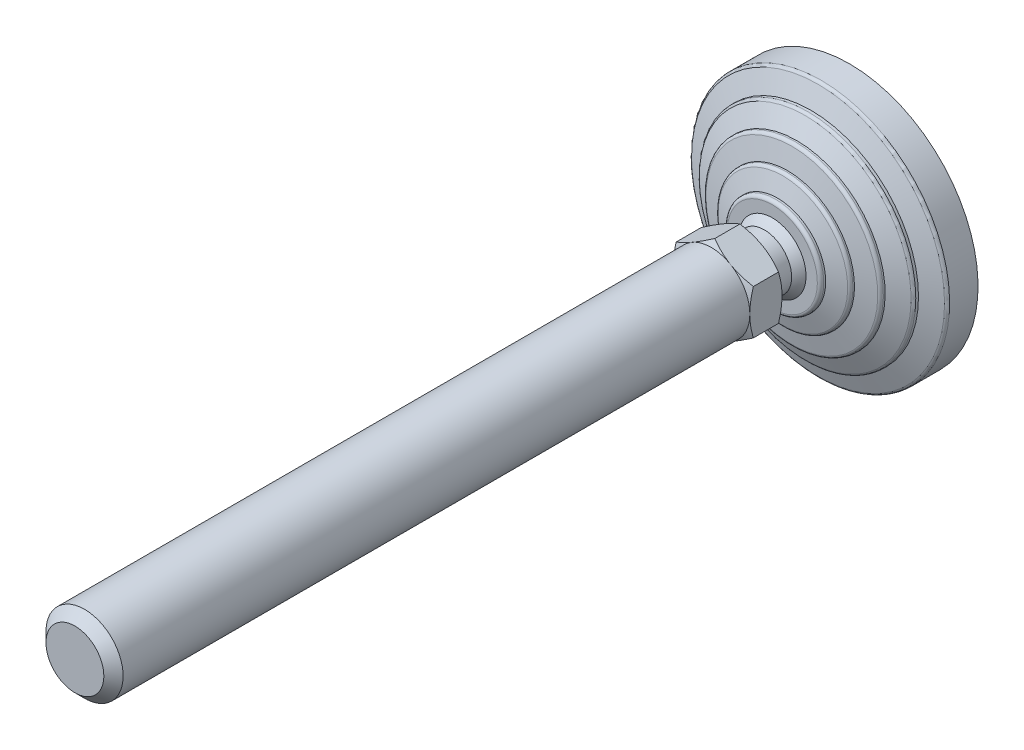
ISO-10303-21;
HEADER;
FILE_DESCRIPTION(('STEP AP214'),'2;1');
FILE_NAME('part.step','',(''),(''),'','','');
FILE_SCHEMA(('AUTOMOTIVE_DESIGN { 1 0 10303 214 1 1 1 1 }'));
ENDSEC;
DATA;
#1=APPLICATION_CONTEXT('core data for automotive mechanical design processes');
#2=APPLICATION_PROTOCOL_DEFINITION('international standard','automotive_design',2000,#1);
#3=PRODUCT_CONTEXT('',#1,'mechanical');
#4=PRODUCT('Part','Part','',(#3));
#5=PRODUCT_RELATED_PRODUCT_CATEGORY('part','',(#4));
#6=PRODUCT_DEFINITION_FORMATION('','',#4);
#7=PRODUCT_DEFINITION_CONTEXT('part definition',#1,'design');
#8=PRODUCT_DEFINITION('design','',#6,#7);
#9=PRODUCT_DEFINITION_SHAPE('','',#8);
#10=(LENGTH_UNIT() NAMED_UNIT(*) SI_UNIT(.MILLI.,.METRE.));
#11=(NAMED_UNIT(*) PLANE_ANGLE_UNIT() SI_UNIT($,.RADIAN.));
#12=(NAMED_UNIT(*) SI_UNIT($,.STERADIAN.) SOLID_ANGLE_UNIT());
#13=UNCERTAINTY_MEASURE_WITH_UNIT(LENGTH_MEASURE(1.E-05),#10,'distance_accuracy_value','');
#14=(GEOMETRIC_REPRESENTATION_CONTEXT(3) GLOBAL_UNCERTAINTY_ASSIGNED_CONTEXT((#13)) GLOBAL_UNIT_ASSIGNED_CONTEXT((#10,
#11,#12)) REPRESENTATION_CONTEXT('',''));
#15=CARTESIAN_POINT('',(0.,0.,0.));
#16=DIRECTION('',(0.,0.,1.));
#17=DIRECTION('',(1.,0.,0.));
#18=AXIS2_PLACEMENT_3D('',#15,#16,#17);
#19=CARTESIAN_POINT('',(-8.49999999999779,0.,35.9999999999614));
#20=DIRECTION('',(0.,0.,1.));
#21=DIRECTION('',(0.,-1.,0.));
#22=AXIS2_PLACEMENT_3D('',#19,#20,#21);
#23=PLANE('',#22);
#24=CARTESIAN_POINT('',(0.,0.,35.9999999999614));
#25=DIRECTION('',(0.,0.,-1.));
#26=DIRECTION('',(0.,1.,0.));
#27=AXIS2_PLACEMENT_3D('',#24,#25,#26);
#28=CIRCLE('',#27,8.49999999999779);
#29=CARTESIAN_POINT('',(0.,8.49999999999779,35.9999999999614));
#30=VERTEX_POINT('',#29);
#31=EDGE_CURVE('E345',#30,#30,#28,.T.);
#32=ORIENTED_EDGE('',*,*,#31,.F.);
#33=EDGE_LOOP('',(#32));
#34=FACE_BOUND('',#33,.T.);
#35=CARTESIAN_POINT('',(0.,0.,35.9999999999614));
#36=DIRECTION('',(0.,0.,-1.));
#37=DIRECTION('',(-1.,0.,0.));
#38=AXIS2_PLACEMENT_3D('',#35,#36,#37);
#39=CIRCLE('',#38,11.9999999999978);
#40=CARTESIAN_POINT('',(6.,10.3923048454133,35.9999999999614));
#41=VERTEX_POINT('',#40);
#42=CARTESIAN_POINT('',(12.,0.,35.9999999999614));
#43=VERTEX_POINT('',#42);
#44=EDGE_CURVE('E507',#41,#43,#39,.T.);
#45=ORIENTED_EDGE('',*,*,#44,.T.);
#46=CARTESIAN_POINT('',(6.,-10.3923048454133,35.9999999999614));
#47=VERTEX_POINT('',#46);
#48=EDGE_CURVE('E140',#43,#47,#39,.T.);
#49=ORIENTED_EDGE('',*,*,#48,.T.);
#50=CARTESIAN_POINT('',(-6.,-10.3923048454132,35.9999999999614));
#51=VERTEX_POINT('',#50);
#52=EDGE_CURVE('E139',#47,#51,#39,.T.);
#53=ORIENTED_EDGE('',*,*,#52,.T.);
#54=CARTESIAN_POINT('',(-12.,0.,35.9999999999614));
#55=VERTEX_POINT('',#54);
#56=EDGE_CURVE('E117',#51,#55,#39,.T.);
#57=ORIENTED_EDGE('',*,*,#56,.T.);
#58=CARTESIAN_POINT('',(-6.,10.3923048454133,35.9999999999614));
#59=VERTEX_POINT('',#58);
#60=EDGE_CURVE('E105',#55,#59,#39,.T.);
#61=ORIENTED_EDGE('',*,*,#60,.T.);
#62=EDGE_CURVE('E34',#59,#41,#39,.T.);
#63=ORIENTED_EDGE('',*,*,#62,.T.);
#64=EDGE_LOOP('',(#45,#49,#53,#57,#61,#63));
#65=FACE_BOUND('',#64,.T.);
#66=ADVANCED_FACE('F14',(#34,#65),#23,.F.);
#67=CARTESIAN_POINT('',(0.,0.,0.));
#68=DIRECTION('',(0.,0.,-1.));
#69=DIRECTION('',(0.,1.,0.));
#70=AXIS2_PLACEMENT_3D('',#67,#68,#69);
#71=CYLINDRICAL_SURFACE('',#70,8.49999999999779);
#72=CARTESIAN_POINT('',(0.,0.,29.4999999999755));
#73=DIRECTION('',(0.,0.,-1.));
#74=DIRECTION('',(0.,1.,0.));
#75=AXIS2_PLACEMENT_3D('',#72,#73,#74);
#76=CIRCLE('',#75,8.49999999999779);
#77=CARTESIAN_POINT('',(0.,8.49999999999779,29.4999999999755));
#78=VERTEX_POINT('',#77);
#79=EDGE_CURVE('E348',#78,#78,#76,.T.);
#80=ORIENTED_EDGE('',*,*,#79,.F.);
#81=EDGE_LOOP('',(#80));
#82=FACE_BOUND('',#81,.T.);
#83=ORIENTED_EDGE('',*,*,#31,.T.);
#84=EDGE_LOOP('',(#83));
#85=FACE_BOUND('',#84,.T.);
#86=ADVANCED_FACE('F313',(#82,#85),#71,.T.);
#87=CARTESIAN_POINT('',(-8.49999999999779,0.,29.4999999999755));
#88=DIRECTION('',(0.,0.,1.));
#89=DIRECTION('',(0.,-1.,0.));
#90=AXIS2_PLACEMENT_3D('',#87,#88,#89);
#91=PLANE('',#90);
#92=CARTESIAN_POINT('',(0.,0.,29.4999999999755));
#93=DIRECTION('',(0.,0.,-1.));
#94=DIRECTION('',(0.,1.,0.));
#95=AXIS2_PLACEMENT_3D('',#92,#93,#94);
#96=CIRCLE('',#95,8.49107182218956);
#97=CARTESIAN_POINT('',(-8.49107182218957,0.,29.4999999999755));
#98=VERTEX_POINT('',#97);
#99=EDGE_CURVE('E351',#98,#98,#96,.T.);
#100=ORIENTED_EDGE('',*,*,#99,.F.);
#101=EDGE_LOOP('',(#100));
#102=FACE_BOUND('',#101,.T.);
#103=ORIENTED_EDGE('',*,*,#79,.T.);
#104=EDGE_LOOP('',(#103));
#105=FACE_BOUND('',#104,.T.);
#106=ADVANCED_FACE('F309',(#102,#105),#91,.F.);
#107=CARTESIAN_POINT('',(-2.99760216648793E-12,0.,20.6702661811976));
#108=DIRECTION('',(0.,0.,-1.));
#109=DIRECTION('',(-1.,0.,0.));
#110=AXIS2_PLACEMENT_3D('',#107,#108,#109);
#111=SPHERICAL_SURFACE('',#110,12.25);
#112=CARTESIAN_POINT('',(0.,0.,27.));
#113=DIRECTION('',(0.,0.,-1.));
#114=DIRECTION('',(0.,1.,0.));
#115=AXIS2_PLACEMENT_3D('',#112,#113,#114);
#116=CIRCLE('',#115,10.4879440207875);
#117=CARTESIAN_POINT('',(-10.4879440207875,0.,27.));
#118=VERTEX_POINT('',#117);
#119=EDGE_CURVE('E354',#118,#118,#116,.T.);
#120=CARTESIAN_POINT('',(-10.4879440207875,0.,27.));
#121=CARTESIAN_POINT('',(-10.4706730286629,0.,27.0286168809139));
#122=CARTESIAN_POINT('',(-10.4532849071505,0.,27.0571630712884));
#123=CARTESIAN_POINT('',(-10.4182755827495,0.,27.1141121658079));
#124=CARTESIAN_POINT('',(-10.4006543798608,0.,27.1425150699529));
#125=CARTESIAN_POINT('',(-10.3651800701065,0.,27.1991756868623));
#126=CARTESIAN_POINT('',(-10.3473269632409,0.,27.2274333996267));
#127=CARTESIAN_POINT('',(-10.3113900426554,0.,27.283801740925));
#128=CARTESIAN_POINT('',(-10.2933062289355,0.,27.3119123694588));
#129=CARTESIAN_POINT('',(-10.2569091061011,0.,27.367984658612));
#130=CARTESIAN_POINT('',(-10.2385957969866,0.,27.3959463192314));
#131=CARTESIAN_POINT('',(-10.2017409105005,0.,27.4517187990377));
#132=CARTESIAN_POINT('',(-10.1831993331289,0.,27.4795296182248));
#133=CARTESIAN_POINT('',(-10.1458891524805,0.,27.5349985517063));
#134=CARTESIAN_POINT('',(-10.1271205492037,0.,27.5626566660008));
#135=CARTESIAN_POINT('',(-10.08935757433,0.,27.6178183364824));
#136=CARTESIAN_POINT('',(-10.0703632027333,0.,27.6453218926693));
#137=CARTESIAN_POINT('',(-10.0321499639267,0.,27.7001726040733));
#138=CARTESIAN_POINT('',(-10.0129310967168,0.,27.7275197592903));
#139=CARTESIAN_POINT('',(-9.97427015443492,0.,27.7820558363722));
#140=CARTESIAN_POINT('',(-9.9548280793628,0.,27.8092447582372));
#141=CARTESIAN_POINT('',(-9.91572202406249,0.,27.8634625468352));
#142=CARTESIAN_POINT('',(-9.8960580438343,0.,27.8904914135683));
#143=CARTESIAN_POINT('',(-9.85650949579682,0.,27.9443872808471));
#144=CARTESIAN_POINT('',(-9.83662492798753,0.,27.9712542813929));
#145=CARTESIAN_POINT('',(-9.79663653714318,0.,28.0248246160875));
#146=CARTESIAN_POINT('',(-9.77653271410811,0.,28.0515279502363));
#147=CARTESIAN_POINT('',(-9.73610715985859,0.,28.1047691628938));
#148=CARTESIAN_POINT('',(-9.71578542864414,0.,28.1313070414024));
#149=CARTESIAN_POINT('',(-9.67492541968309,0.,28.1842155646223));
#150=CARTESIAN_POINT('',(-9.65438714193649,0.,28.2105862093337));
#151=CARTESIAN_POINT('',(-9.61309541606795,0.,28.2631584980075));
#152=CARTESIAN_POINT('',(-9.59234196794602,0.,28.2893601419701));
#153=CARTESIAN_POINT('',(-9.55062129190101,0.,28.3415926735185));
#154=CARTESIAN_POINT('',(-9.52965406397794,0.,28.3676235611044));
#155=CARTESIAN_POINT('',(-9.48750723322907,0.,28.4195128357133));
#156=CARTESIAN_POINT('',(-9.46632763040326,0.,28.4453712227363));
#157=CARTESIAN_POINT('',(-9.42375746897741,0.,28.4969137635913));
#158=CARTESIAN_POINT('',(-9.40236691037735,0.,28.5225979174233));
#159=CARTESIAN_POINT('',(-9.35937627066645,0.,28.5737902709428));
#160=CARTESIAN_POINT('',(-9.3377761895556,0.,28.5992984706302));
#161=CARTESIAN_POINT('',(-9.29436795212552,0.,28.6501372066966));
#162=CARTESIAN_POINT('',(-9.27255979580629,0.,28.6754677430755));
#163=CARTESIAN_POINT('',(-9.22873686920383,0.,28.7259494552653));
#164=CARTESIAN_POINT('',(-9.2067220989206,0.,28.7511006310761));
#165=CARTESIAN_POINT('',(-9.16248741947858,0.,28.8012219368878));
#166=CARTESIAN_POINT('',(-9.14026751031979,0.,28.8261920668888));
#167=CARTESIAN_POINT('',(-9.09562404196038,0.,28.87594960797));
#168=CARTESIAN_POINT('',(-9.07320048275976,0.,28.9007370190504));
#169=CARTESIAN_POINT('',(-9.02815121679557,0.,28.9501274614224));
#170=CARTESIAN_POINT('',(-9.005525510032,0.,28.974730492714));
#171=CARTESIAN_POINT('',(-8.96007346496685,0.,29.023750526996));
#172=CARTESIAN_POINT('',(-8.93724712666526,0.,29.0481675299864));
#173=CARTESIAN_POINT('',(-8.89139534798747,0.,29.0968138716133));
#174=CARTESIAN_POINT('',(-8.86836990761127,0.,29.1210432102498));
#175=CARTESIAN_POINT('',(-8.82212146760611,0.,29.1693125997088));
#176=CARTESIAN_POINT('',(-8.79889846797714,0.,29.1933526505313));
#177=CARTESIAN_POINT('',(-8.75225646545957,0.,29.2412418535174));
#178=CARTESIAN_POINT('',(-8.72883746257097,0.,29.2650910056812));
#179=CARTESIAN_POINT('',(-8.6818050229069,0.,29.3125968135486));
#180=CARTESIAN_POINT('',(-8.65819158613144,0.,29.3362534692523));
#181=CARTESIAN_POINT('',(-8.61077186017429,0.,29.3833726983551));
#182=CARTESIAN_POINT('',(-8.58696557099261,0.,29.4068352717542));
#183=CARTESIAN_POINT('',(-8.53916173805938,0.,29.4535647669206));
#184=CARTESIAN_POINT('',(-8.51516419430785,0.,29.4768316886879));
#185=CARTESIAN_POINT('',(-8.49107182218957,0.,29.4999999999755));
#186=B_SPLINE_CURVE_WITH_KNOTS('',3,(#120,#121,#122,#123,#124,#125,#126,#127,#128,#129,#130,
#131,#132,#133,#134,#135,#136,#137,#138,#139,#140,#141,#142,#143,#144,#145,#146,#147,#148,#149,
#150,#151,#152,#153,#154,#155,#156,#157,#158,#159,#160,#161,#162,#163,#164,#165,#166,#167,#168,
#169,#170,#171,#172,#173,#174,#175,#176,#177,#178,#179,#180,#181,#182,#183,#184,#185),
.UNSPECIFIED.,.F.,.F.,(4,2,2,2,2,2,2,2,2,2,2,2,2,2,2,2,2,2,2,2,2,2,2,2,2,2,2,2,2,2,2,2,4),(0.,
0.100273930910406,0.200547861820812,0.300821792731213,0.401095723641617,0.501369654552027,
0.60164358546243,0.701917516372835,0.802191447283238,0.902465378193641,1.00273930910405,
1.10301324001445,1.20328717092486,1.30356110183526,1.40383503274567,1.50410896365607,
1.60438289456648,1.70465682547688,1.80493075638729,1.90520468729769,2.00547861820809,
2.1057525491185,2.20602648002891,2.30630041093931,2.40657434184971,2.50684827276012,
2.60712220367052,2.70739613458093,2.80767006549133,2.90794399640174,3.00821792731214,
3.10849185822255,3.20876578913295),.UNSPECIFIED.);
#187=EDGE_CURVE('BSEAM305',#118,#98,#186,.T.);
#188=ORIENTED_EDGE('',*,*,#119,.F.);
#189=ORIENTED_EDGE('',*,*,#99,.T.);
#190=ORIENTED_EDGE('',*,*,#187,.T.);
#191=ORIENTED_EDGE('',*,*,#187,.F.);
#192=EDGE_LOOP('',(#188,#190,#189,#191));
#193=FACE_BOUND('',#192,.T.);
#194=ADVANCED_FACE('F305',(#193),#111,.T.);
#195=CARTESIAN_POINT('',(-10.4879440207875,0.,27.));
#196=DIRECTION('',(0.,0.,-1.));
#197=DIRECTION('',(0.,1.,0.));
#198=AXIS2_PLACEMENT_3D('',#195,#196,#197);
#199=PLANE('',#198);
#200=CARTESIAN_POINT('',(0.,0.,27.));
#201=DIRECTION('',(0.,0.,-1.));
#202=DIRECTION('',(0.,1.,0.));
#203=AXIS2_PLACEMENT_3D('',#200,#201,#202);
#204=CIRCLE('',#203,14.);
#205=CARTESIAN_POINT('',(0.,14.,27.));
#206=VERTEX_POINT('',#205);
#207=EDGE_CURVE('E357',#206,#206,#204,.T.);
#208=ORIENTED_EDGE('',*,*,#207,.F.);
#209=EDGE_LOOP('',(#208));
#210=FACE_BOUND('',#209,.T.);
#211=ORIENTED_EDGE('',*,*,#119,.T.);
#212=EDGE_LOOP('',(#211));
#213=FACE_BOUND('',#212,.T.);
#214=ADVANCED_FACE('F301',(#210,#213),#199,.F.);
#215=CARTESIAN_POINT('',(0.,0.,26.));
#216=DIRECTION('',(0.,0.,-1.));
#217=DIRECTION('',(0.,1.,0.));
#218=AXIS2_PLACEMENT_3D('',#215,#216,#217);
#219=TOROIDAL_SURFACE('',#218,14.,1.);
#220=CARTESIAN_POINT('',(0.,0.,26.));
#221=DIRECTION('',(0.,0.,-1.));
#222=DIRECTION('',(0.,1.,0.));
#223=AXIS2_PLACEMENT_3D('',#220,#221,#222);
#224=CIRCLE('',#223,15.);
#225=CARTESIAN_POINT('',(0.,15.,26.));
#226=VERTEX_POINT('',#225);
#227=EDGE_CURVE('E360',#226,#226,#224,.T.);
#228=ORIENTED_EDGE('',*,*,#227,.F.);
#229=EDGE_LOOP('',(#228));
#230=FACE_BOUND('',#229,.T.);
#231=ORIENTED_EDGE('',*,*,#207,.T.);
#232=EDGE_LOOP('',(#231));
#233=FACE_BOUND('',#232,.T.);
#234=ADVANCED_FACE('F297',(#230,#233),#219,.T.);
#235=CARTESIAN_POINT('',(0.,0.,0.));
#236=DIRECTION('',(0.,0.,-1.));
#237=DIRECTION('',(0.,1.,0.));
#238=AXIS2_PLACEMENT_3D('',#235,#236,#237);
#239=CYLINDRICAL_SURFACE('',#238,15.);
#240=CARTESIAN_POINT('',(0.,0.,25.4025287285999));
#241=DIRECTION('',(0.,0.,-1.));
#242=DIRECTION('',(0.,1.,0.));
#243=AXIS2_PLACEMENT_3D('',#240,#241,#242);
#244=CIRCLE('',#243,15.);
#245=CARTESIAN_POINT('',(0.,15.,25.4025287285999));
#246=VERTEX_POINT('',#245);
#247=EDGE_CURVE('E363',#246,#246,#244,.T.);
#248=ORIENTED_EDGE('',*,*,#247,.F.);
#249=EDGE_LOOP('',(#248));
#250=FACE_BOUND('',#249,.T.);
#251=ORIENTED_EDGE('',*,*,#227,.T.);
#252=EDGE_LOOP('',(#251));
#253=FACE_BOUND('',#252,.T.);
#254=ADVANCED_FACE('F293',(#250,#253),#239,.T.);
#255=CARTESIAN_POINT('',(0.,0.,25.4025287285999));
#256=DIRECTION('',(0.,0.,-1.));
#257=DIRECTION('',(0.,1.,0.));
#258=AXIS2_PLACEMENT_3D('',#255,#256,#257);
#259=CONICAL_SURFACE('',#258,15.,1.25589726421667);
#260=CARTESIAN_POINT('',(0.,0.,23.7216684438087));
#261=DIRECTION('',(0.,0.,-1.));
#262=DIRECTION('',(0.,1.,0.));
#263=AXIS2_PLACEMENT_3D('',#260,#261,#262);
#264=CIRCLE('',#263,20.1601635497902);
#265=CARTESIAN_POINT('',(0.,20.1601635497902,23.7216684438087));
#266=VERTEX_POINT('',#265);
#267=EDGE_CURVE('E366',#266,#266,#264,.T.);
#268=ORIENTED_EDGE('',*,*,#267,.F.);
#269=EDGE_LOOP('',(#268));
#270=FACE_BOUND('',#269,.T.);
#271=ORIENTED_EDGE('',*,*,#247,.T.);
#272=EDGE_LOOP('',(#271));
#273=FACE_BOUND('',#272,.T.);
#274=ADVANCED_FACE('F289',(#270,#273),#259,.T.);
#275=CARTESIAN_POINT('',(0.,0.,22.7708407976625));
#276=DIRECTION('',(0.,0.,-1.));
#277=DIRECTION('',(0.,1.,0.));
#278=AXIS2_PLACEMENT_3D('',#275,#276,#277);
#279=TOROIDAL_SURFACE('',#278,19.8504430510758,1.00000000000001);
#280=CARTESIAN_POINT('',(0.,0.,22.7708407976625));
#281=DIRECTION('',(0.,0.,-1.));
#282=DIRECTION('',(0.,1.,0.));
#283=AXIS2_PLACEMENT_3D('',#280,#281,#282);
#284=CIRCLE('',#283,20.8504430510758);
#285=CARTESIAN_POINT('',(0.,20.8504430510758,22.7708407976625));
#286=VERTEX_POINT('',#285);
#287=EDGE_CURVE('E369',#286,#286,#284,.T.);
#288=ORIENTED_EDGE('',*,*,#287,.F.);
#289=EDGE_LOOP('',(#288));
#290=FACE_BOUND('',#289,.T.);
#291=ORIENTED_EDGE('',*,*,#267,.T.);
#292=EDGE_LOOP('',(#291));
#293=FACE_BOUND('',#292,.T.);
#294=ADVANCED_FACE('F285',(#290,#293),#279,.T.);
#295=CARTESIAN_POINT('',(0.,0.,0.));
#296=DIRECTION('',(0.,0.,-1.));
#297=DIRECTION('',(0.,1.,0.));
#298=AXIS2_PLACEMENT_3D('',#295,#296,#297);
#299=CYLINDRICAL_SURFACE('',#298,20.8504430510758);
#300=CARTESIAN_POINT('',(0.,0.,22.2987385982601));
#301=DIRECTION('',(0.,0.,-1.));
#302=DIRECTION('',(0.,1.,0.));
#303=AXIS2_PLACEMENT_3D('',#300,#301,#302);
#304=CIRCLE('',#303,20.8504430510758);
#305=CARTESIAN_POINT('',(0.,20.8504430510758,22.2987385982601));
#306=VERTEX_POINT('',#305);
#307=EDGE_CURVE('E372',#306,#306,#304,.T.);
#308=ORIENTED_EDGE('',*,*,#307,.F.);
#309=EDGE_LOOP('',(#308));
#310=FACE_BOUND('',#309,.T.);
#311=ORIENTED_EDGE('',*,*,#287,.T.);
#312=EDGE_LOOP('',(#311));
#313=FACE_BOUND('',#312,.T.);
#314=ADVANCED_FACE('F281',(#310,#313),#299,.T.);
#315=CARTESIAN_POINT('',(0.,0.,22.2987385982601));
#316=DIRECTION('',(0.,0.,-1.));
#317=DIRECTION('',(0.,1.,0.));
#318=AXIS2_PLACEMENT_3D('',#315,#316,#317);
#319=CONICAL_SURFACE('',#318,20.8504430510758,1.34067144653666);
#320=CARTESIAN_POINT('',(0.,0.,20.9217501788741));
#321=DIRECTION('',(0.,0.,-1.));
#322=DIRECTION('',(0.,1.,0.));
#323=AXIS2_PLACEMENT_3D('',#320,#321,#322);
#324=CIRCLE('',#323,26.7280991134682);
#325=CARTESIAN_POINT('',(0.,26.7280991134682,20.9217501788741));
#326=VERTEX_POINT('',#325);
#327=EDGE_CURVE('E375',#326,#326,#324,.T.);
#328=ORIENTED_EDGE('',*,*,#327,.F.);
#329=EDGE_LOOP('',(#328));
#330=FACE_BOUND('',#329,.T.);
#331=ORIENTED_EDGE('',*,*,#307,.T.);
#332=EDGE_LOOP('',(#331));
#333=FACE_BOUND('',#332,.T.);
#334=ADVANCED_FACE('F277',(#330,#333),#319,.T.);
#335=CARTESIAN_POINT('',(0.,0.,19.9481122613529));
#336=DIRECTION('',(0.,0.,-1.));
#337=DIRECTION('',(0.,1.,0.));
#338=AXIS2_PLACEMENT_3D('',#335,#336,#337);
#339=TOROIDAL_SURFACE('',#338,26.5,1.);
#340=CARTESIAN_POINT('',(0.,0.,19.9481122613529));
#341=DIRECTION('',(0.,0.,-1.));
#342=DIRECTION('',(0.,1.,0.));
#343=AXIS2_PLACEMENT_3D('',#340,#341,#342);
#344=CIRCLE('',#343,27.5);
#345=CARTESIAN_POINT('',(0.,27.5,19.9481122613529));
#346=VERTEX_POINT('',#345);
#347=EDGE_CURVE('E378',#346,#346,#344,.T.);
#348=ORIENTED_EDGE('',*,*,#347,.F.);
#349=EDGE_LOOP('',(#348));
#350=FACE_BOUND('',#349,.T.);
#351=ORIENTED_EDGE('',*,*,#327,.T.);
#352=EDGE_LOOP('',(#351));
#353=FACE_BOUND('',#352,.T.);
#354=ADVANCED_FACE('F273',(#350,#353),#339,.T.);
#355=CARTESIAN_POINT('',(0.,0.,0.));
#356=DIRECTION('',(0.,0.,-1.));
#357=DIRECTION('',(0.,1.,0.));
#358=AXIS2_PLACEMENT_3D('',#355,#356,#357);
#359=CYLINDRICAL_SURFACE('',#358,27.5);
#360=CARTESIAN_POINT('',(0.,0.,19.4025287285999));
#361=DIRECTION('',(0.,0.,-1.));
#362=DIRECTION('',(0.,1.,0.));
#363=AXIS2_PLACEMENT_3D('',#360,#361,#362);
#364=CIRCLE('',#363,27.5);
#365=CARTESIAN_POINT('',(0.,27.5,19.4025287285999));
#366=VERTEX_POINT('',#365);
#367=EDGE_CURVE('E381',#366,#366,#364,.T.);
#368=ORIENTED_EDGE('',*,*,#367,.F.);
#369=EDGE_LOOP('',(#368));
#370=FACE_BOUND('',#369,.T.);
#371=ORIENTED_EDGE('',*,*,#347,.T.);
#372=EDGE_LOOP('',(#371));
#373=FACE_BOUND('',#372,.T.);
#374=ADVANCED_FACE('F269',(#370,#373),#359,.T.);
#375=CARTESIAN_POINT('',(0.,0.,19.4025287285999));
#376=DIRECTION('',(0.,0.,-1.));
#377=DIRECTION('',(0.,1.,0.));
#378=AXIS2_PLACEMENT_3D('',#375,#376,#377);
#379=CONICAL_SURFACE('',#378,27.5,1.12022914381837);
#380=CARTESIAN_POINT('',(0.,0.,16.7730910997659));
#381=DIRECTION('',(0.,0.,-1.));
#382=DIRECTION('',(0.,1.,0.));
#383=AXIS2_PLACEMENT_3D('',#380,#381,#382);
#384=CIRCLE('',#383,32.9354761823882);
#385=CARTESIAN_POINT('',(0.,32.9354761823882,16.7730910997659));
#386=VERTEX_POINT('',#385);
#387=EDGE_CURVE('E384',#386,#386,#384,.T.);
#388=ORIENTED_EDGE('',*,*,#387,.F.);
#389=EDGE_LOOP('',(#388));
#390=FACE_BOUND('',#389,.T.);
#391=ORIENTED_EDGE('',*,*,#367,.T.);
#392=EDGE_LOOP('',(#391));
#393=FACE_BOUND('',#392,.T.);
#394=ADVANCED_FACE('F265',(#390,#393),#379,.T.);
#395=CARTESIAN_POINT('',(0.,0.,15.8728908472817));
#396=DIRECTION('',(0.,0.,-1.));
#397=DIRECTION('',(0.,1.,0.));
#398=AXIS2_PLACEMENT_3D('',#395,#396,#397);
#399=TOROIDAL_SURFACE('',#398,32.5,1.);
#400=CARTESIAN_POINT('',(0.,0.,15.8728908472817));
#401=DIRECTION('',(0.,0.,-1.));
#402=DIRECTION('',(0.,1.,0.));
#403=AXIS2_PLACEMENT_3D('',#400,#401,#402);
#404=CIRCLE('',#403,33.5);
#405=CARTESIAN_POINT('',(0.,33.5,15.8728908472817));
#406=VERTEX_POINT('',#405);
#407=EDGE_CURVE('E387',#406,#406,#404,.T.);
#408=ORIENTED_EDGE('',*,*,#407,.F.);
#409=EDGE_LOOP('',(#408));
#410=FACE_BOUND('',#409,.T.);
#411=ORIENTED_EDGE('',*,*,#387,.T.);
#412=EDGE_LOOP('',(#411));
#413=FACE_BOUND('',#412,.T.);
#414=ADVANCED_FACE('F261',(#410,#413),#399,.T.);
#415=CARTESIAN_POINT('',(0.,0.,0.));
#416=DIRECTION('',(0.,0.,-1.));
#417=DIRECTION('',(0.,1.,0.));
#418=AXIS2_PLACEMENT_3D('',#415,#416,#417);
#419=CYLINDRICAL_SURFACE('',#418,33.5);
#420=CARTESIAN_POINT('',(0.,0.,15.0315037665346));
#421=DIRECTION('',(0.,0.,-1.));
#422=DIRECTION('',(0.,1.,0.));
#423=AXIS2_PLACEMENT_3D('',#420,#421,#422);
#424=CIRCLE('',#423,33.5);
#425=CARTESIAN_POINT('',(0.,33.5,15.0315037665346));
#426=VERTEX_POINT('',#425);
#427=EDGE_CURVE('E390',#426,#426,#424,.T.);
#428=ORIENTED_EDGE('',*,*,#427,.F.);
#429=EDGE_LOOP('',(#428));
#430=FACE_BOUND('',#429,.T.);
#431=ORIENTED_EDGE('',*,*,#407,.T.);
#432=EDGE_LOOP('',(#431));
#433=FACE_BOUND('',#432,.T.);
#434=ADVANCED_FACE('F257',(#430,#433),#419,.T.);
#435=CARTESIAN_POINT('',(0.,0.,15.0315037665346));
#436=DIRECTION('',(0.,0.,-1.));
#437=DIRECTION('',(0.,1.,0.));
#438=AXIS2_PLACEMENT_3D('',#435,#436,#437);
#439=CONICAL_SURFACE('',#438,33.5,1.20362249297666);
#440=CARTESIAN_POINT('',(0.,0.,12.7780502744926));
#441=DIRECTION('',(0.,0.,-1.));
#442=DIRECTION('',(0.,1.,0.));
#443=AXIS2_PLACEMENT_3D('',#440,#441,#442);
#444=CIRCLE('',#443,39.358979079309);
#445=CARTESIAN_POINT('',(0.,39.358979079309,12.7780502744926));
#446=VERTEX_POINT('',#445);
#447=EDGE_CURVE('E393',#446,#446,#444,.T.);
#448=ORIENTED_EDGE('',*,*,#447,.F.);
#449=EDGE_LOOP('',(#448));
#450=FACE_BOUND('',#449,.T.);
#451=ORIENTED_EDGE('',*,*,#427,.T.);
#452=EDGE_LOOP('',(#451));
#453=FACE_BOUND('',#452,.T.);
#454=ADVANCED_FACE('F253',(#450,#453),#439,.T.);
#455=CARTESIAN_POINT('',(0.,0.,11.8447046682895));
#456=DIRECTION('',(0.,0.,-1.));
#457=DIRECTION('',(0.,1.,0.));
#458=AXIS2_PLACEMENT_3D('',#455,#456,#457);
#459=TOROIDAL_SURFACE('',#458,39.,1.);
#460=CARTESIAN_POINT('',(0.,0.,11.8447046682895));
#461=DIRECTION('',(0.,0.,-1.));
#462=DIRECTION('',(0.,1.,0.));
#463=AXIS2_PLACEMENT_3D('',#460,#461,#462);
#464=CIRCLE('',#463,40.);
#465=CARTESIAN_POINT('',(0.,40.,11.8447046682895));
#466=VERTEX_POINT('',#465);
#467=EDGE_CURVE('E396',#466,#466,#464,.T.);
#468=ORIENTED_EDGE('',*,*,#467,.F.);
#469=EDGE_LOOP('',(#468));
#470=FACE_BOUND('',#469,.T.);
#471=ORIENTED_EDGE('',*,*,#447,.T.);
#472=EDGE_LOOP('',(#471));
#473=FACE_BOUND('',#472,.T.);
#474=ADVANCED_FACE('F249',(#470,#473),#459,.T.);
#475=CARTESIAN_POINT('',(0.,0.,0.));
#476=DIRECTION('',(0.,0.,-1.));
#477=DIRECTION('',(0.,1.,0.));
#478=AXIS2_PLACEMENT_3D('',#475,#476,#477);
#479=CYLINDRICAL_SURFACE('',#478,40.);
#480=CARTESIAN_POINT('',(0.,0.,3.));
#481=DIRECTION('',(0.,0.,-1.));
#482=DIRECTION('',(0.,1.,0.));
#483=AXIS2_PLACEMENT_3D('',#480,#481,#482);
#484=CIRCLE('',#483,40.);
#485=CARTESIAN_POINT('',(0.,40.,3.));
#486=VERTEX_POINT('',#485);
#487=EDGE_CURVE('E399',#486,#486,#484,.T.);
#488=ORIENTED_EDGE('',*,*,#487,.F.);
#489=EDGE_LOOP('',(#488));
#490=FACE_BOUND('',#489,.T.);
#491=ORIENTED_EDGE('',*,*,#467,.T.);
#492=EDGE_LOOP('',(#491));
#493=FACE_BOUND('',#492,.T.);
#494=ADVANCED_FACE('F245',(#490,#493),#479,.T.);
#495=CARTESIAN_POINT('',(-33.5,0.,3.));
#496=DIRECTION('',(0.,0.,1.));
#497=DIRECTION('',(0.,-1.,0.));
#498=AXIS2_PLACEMENT_3D('',#495,#496,#497);
#499=PLANE('',#498);
#500=CARTESIAN_POINT('',(0.,0.,3.));
#501=DIRECTION('',(0.,0.,-1.));
#502=DIRECTION('',(0.,1.,0.));
#503=AXIS2_PLACEMENT_3D('',#500,#501,#502);
#504=CIRCLE('',#503,33.5);
#505=CARTESIAN_POINT('',(0.,33.5,3.));
#506=VERTEX_POINT('',#505);
#507=EDGE_CURVE('E402',#506,#506,#504,.T.);
#508=ORIENTED_EDGE('',*,*,#507,.F.);
#509=EDGE_LOOP('',(#508));
#510=FACE_BOUND('',#509,.T.);
#511=ORIENTED_EDGE('',*,*,#487,.T.);
#512=EDGE_LOOP('',(#511));
#513=FACE_BOUND('',#512,.T.);
#514=ADVANCED_FACE('F241',(#510,#513),#499,.F.);
#515=CARTESIAN_POINT('',(0.,0.,0.));
#516=DIRECTION('',(0.,0.,-1.));
#517=DIRECTION('',(0.,1.,0.));
#518=AXIS2_PLACEMENT_3D('',#515,#516,#517);
#519=CYLINDRICAL_SURFACE('',#518,33.5);
#520=CARTESIAN_POINT('',(0.,0.,0.));
#521=DIRECTION('',(0.,0.,-1.));
#522=DIRECTION('',(0.,1.,0.));
#523=AXIS2_PLACEMENT_3D('',#520,#521,#522);
#524=CIRCLE('',#523,33.5);
#525=CARTESIAN_POINT('',(0.,33.5,0.));
#526=VERTEX_POINT('',#525);
#527=EDGE_CURVE('E405',#526,#526,#524,.T.);
#528=ORIENTED_EDGE('',*,*,#527,.F.);
#529=EDGE_LOOP('',(#528));
#530=FACE_BOUND('',#529,.T.);
#531=ORIENTED_EDGE('',*,*,#507,.T.);
#532=EDGE_LOOP('',(#531));
#533=FACE_BOUND('',#532,.T.);
#534=ADVANCED_FACE('F237',(#530,#533),#519,.T.);
#535=CARTESIAN_POINT('',(0.,0.,0.));
#536=DIRECTION('',(0.,0.,1.));
#537=DIRECTION('',(0.,-1.,0.));
#538=AXIS2_PLACEMENT_3D('',#535,#536,#537);
#539=PLANE('',#538);
#540=ORIENTED_EDGE('',*,*,#527,.T.);
#541=EDGE_LOOP('',(#540));
#542=FACE_BOUND('',#541,.T.);
#543=ADVANCED_FACE('F233',(#542),#539,.F.);
#544=CARTESIAN_POINT('',(0.,0.,38.6039042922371));
#545=DIRECTION('',(0.,0.,1.));
#546=DIRECTION('',(1.,0.,0.));
#547=AXIS2_PLACEMENT_3D('',#544,#545,#546);
#548=CONICAL_SURFACE('',#547,16.5100945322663,1.0471975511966);
#549=CARTESIAN_POINT('',(12.,-18.5879748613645,41.8456347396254));
#550=CARTESIAN_POINT('',(12.,-18.3260220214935,41.7185761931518));
#551=CARTESIAN_POINT('',(12.,-18.0637612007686,41.5921529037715));
#552=CARTESIAN_POINT('',(12.,-17.5385593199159,41.3407207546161));
#553=CARTESIAN_POINT('',(12.,-17.2756182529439,41.2157119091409));
#554=CARTESIAN_POINT('',(12.,-16.4856079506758,40.8429898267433));
#555=CARTESIAN_POINT('',(12.,-15.9574294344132,40.5976188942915));
#556=CARTESIAN_POINT('',(12.,-14.894645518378,40.1132852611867));
#557=CARTESIAN_POINT('',(12.,-14.3600207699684,39.8743649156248));
#558=CARTESIAN_POINT('',(12.,-13.2865120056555,39.4063269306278));
#559=CARTESIAN_POINT('',(12.,-12.7476281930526,39.1772088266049));
#560=CARTESIAN_POINT('',(12.,-11.6474139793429,38.7242348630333));
#561=CARTESIAN_POINT('',(12.,-11.0859169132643,38.5007816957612));
#562=CARTESIAN_POINT('',(12.,-9.95634144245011,38.0708397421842));
#563=CARTESIAN_POINT('',(12.,-9.38826230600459,37.8643528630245));
#564=CARTESIAN_POINT('',(12.,-8.24570804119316,37.4737835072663));
#565=CARTESIAN_POINT('',(12.,-7.67124860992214,37.2896554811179));
#566=CARTESIAN_POINT('',(12.,-6.51403479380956,36.9497166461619));
#567=CARTESIAN_POINT('',(12.,-5.93128309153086,36.7938968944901));
#568=CARTESIAN_POINT('',(12.,-5.05245223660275,36.58747478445));
#569=CARTESIAN_POINT('',(12.,-4.75952833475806,36.5233564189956));
#570=CARTESIAN_POINT('',(12.,-4.17168313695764,36.4049875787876));
#571=CARTESIAN_POINT('',(12.,-3.87676188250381,36.3507368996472));
#572=CARTESIAN_POINT('',(12.,-3.28512659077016,36.2530623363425));
#573=CARTESIAN_POINT('',(12.,-2.98841257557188,36.2096383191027));
#574=CARTESIAN_POINT('',(12.,-2.39350841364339,36.1344842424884));
#575=CARTESIAN_POINT('',(12.,-2.09531832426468,36.1027537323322));
#576=CARTESIAN_POINT('',(12.,-1.50176182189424,36.0520135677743));
#577=CARTESIAN_POINT('',(12.,-1.2064091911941,36.0328436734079));
#578=CARTESIAN_POINT('',(12.,-0.615158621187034,36.0070096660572));
#579=CARTESIAN_POINT('',(12.,-0.319260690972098,36.0003453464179));
#580=CARTESIAN_POINT('',(12.,0.272552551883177,35.999680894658));
#581=CARTESIAN_POINT('',(12.,0.568467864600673,36.0056808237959));
#582=CARTESIAN_POINT('',(12.,1.15978294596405,36.0301989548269));
#583=CARTESIAN_POINT('',(12.,1.45518269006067,36.0487177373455));
#584=CARTESIAN_POINT('',(12.,2.16580115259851,36.1079331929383));
#585=CARTESIAN_POINT('',(12.,2.58053047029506,36.1546074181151));
#586=CARTESIAN_POINT('',(12.,3.40689893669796,36.2700844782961));
#587=CARTESIAN_POINT('',(12.,3.81853765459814,36.3388903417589));
#588=CARTESIAN_POINT('',(12.,4.63833715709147,36.4961829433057));
#589=CARTESIAN_POINT('',(12.,5.04649495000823,36.5846851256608));
#590=CARTESIAN_POINT('',(12.,5.85871009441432,36.7786707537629));
#591=CARTESIAN_POINT('',(12.,6.26276750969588,36.8841539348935));
#592=CARTESIAN_POINT('',(12.,7.07562698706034,37.1120178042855));
#593=CARTESIAN_POINT('',(12.,7.4843387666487,37.2347183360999));
#594=CARTESIAN_POINT('',(12.,8.2977359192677,37.4927416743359));
#595=CARTESIAN_POINT('',(12.,8.70242126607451,37.6280645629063));
#596=CARTESIAN_POINT('',(12.,9.50796625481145,37.9091888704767));
#597=CARTESIAN_POINT('',(12.,9.90882713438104,38.0549867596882));
#598=CARTESIAN_POINT('',(12.,10.7072312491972,38.3553512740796));
#599=CARTESIAN_POINT('',(12.,11.1047745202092,38.5099178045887));
#600=CARTESIAN_POINT('',(12.,12.030038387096,38.8795431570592));
#601=CARTESIAN_POINT('',(12.,12.5566094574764,39.0974748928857));
#602=CARTESIAN_POINT('',(12.,13.605367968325,39.5436718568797));
#603=CARTESIAN_POINT('',(12.,14.1275551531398,39.7719376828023));
#604=CARTESIAN_POINT('',(12.,15.1683442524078,40.2367705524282));
#605=CARTESIAN_POINT('',(12.,15.6869453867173,40.4733393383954));
#606=CARTESIAN_POINT('',(12.,16.7210390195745,40.9531338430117));
#607=CARTESIAN_POINT('',(12.,17.2365315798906,41.1963594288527));
#608=CARTESIAN_POINT('',(12.,18.2654538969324,41.6885017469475));
#609=CARTESIAN_POINT('',(12.,18.7788809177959,41.937424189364));
#610=CARTESIAN_POINT('',(12.,19.8035357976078,42.4397539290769));
#611=CARTESIAN_POINT('',(12.,20.3147636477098,42.6931612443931));
#612=CARTESIAN_POINT('',(12.,21.3352904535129,43.2036723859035));
#613=CARTESIAN_POINT('',(12.,21.8445896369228,43.4607757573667));
#614=CARTESIAN_POINT('',(12.,22.8615961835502,43.9781134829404));
#615=CARTESIAN_POINT('',(12.,23.3693035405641,44.2383478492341));
#616=CARTESIAN_POINT('',(12.,24.8073749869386,44.9801850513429));
#617=CARTESIAN_POINT('',(12.,25.7361258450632,45.4649151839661));
#618=CARTESIAN_POINT('',(12.,27.5901489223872,46.441041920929));
#619=CARTESIAN_POINT('',(12.,28.5154210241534,46.9324387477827));
#620=CARTESIAN_POINT('',(12.,30.3610026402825,47.9191614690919));
#621=CARTESIAN_POINT('',(12.,31.2813187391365,48.4144750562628));
#622=CARTESIAN_POINT('',(12.,32.6601452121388,49.1604291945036));
#623=CARTESIAN_POINT('',(12.,33.1194674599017,49.4095713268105));
#624=CARTESIAN_POINT('',(12.,34.0376240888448,49.9087512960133));
#625=CARTESIAN_POINT('',(12.,34.4964584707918,50.1587891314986));
#626=CARTESIAN_POINT('',(12.,34.9550762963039,50.4092236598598));
#627=B_SPLINE_CURVE_WITH_KNOTS('',3,(#549,#550,#551,#552,#553,#554,#555,#556,#557,#558,#559,
#560,#561,#562,#563,#564,#565,#566,#567,#568,#569,#570,#571,#572,#573,#574,#575,#576,#577,#578,
#579,#580,#581,#582,#583,#584,#585,#586,#587,#588,#589,#590,#591,#592,#593,#594,#595,#596,#597,
#598,#599,#600,#601,#602,#603,#604,#605,#606,#607,#608,#609,#610,#611,#612,#613,#614,#615,#616,
#617,#618,#619,#620,#621,#622,#623,#624,#625,#626),.UNSPECIFIED.,.F.,.F.,(4,2,2,2,2,2,2,2,2,2,2,
2,2,2,2,2,2,2,2,2,2,2,2,2,2,2,2,2,2,2,2,2,2,2,2,2,2,2,4),(0.,0.873421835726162,1.74685249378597,
3.49397340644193,5.25064344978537,7.00723014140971,8.81999970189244,10.6329727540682,
12.4421881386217,14.2508309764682,15.1502694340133,16.0496892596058,16.9490980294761,
17.8484721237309,18.736136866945,19.6237869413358,20.511441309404,21.3991368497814,
22.6504862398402,23.902006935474,25.1545124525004,26.406998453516,27.6869525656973,
28.9669150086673,30.246448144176,31.525967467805,33.2354805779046,34.9450926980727,
36.6550657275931,38.3650046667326,40.0767399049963,41.7884820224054,43.5000153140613,
45.2115552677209,48.3544227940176,51.4973954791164,54.6328015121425,56.2004227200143,
57.7680414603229),.UNSPECIFIED.);
#628=CARTESIAN_POINT('',(12.,6.92820323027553,37.0717967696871));
#629=VERTEX_POINT('',#628);
#630=EDGE_CURVE('E115',#629,#43,#627,.F.);
#631=ORIENTED_EDGE('',*,*,#630,.T.);
#632=ORIENTED_EDGE('',*,*,#44,.F.);
#633=CARTESIAN_POINT('',(-1.62510922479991,14.7946637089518,37.6648764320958));
#634=CARTESIAN_POINT('',(-1.32990238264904,14.6242259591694,37.548480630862));
#635=CARTESIAN_POINT('',(-1.03351320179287,14.4531055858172,37.4359585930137));
#636=CARTESIAN_POINT('',(-0.438130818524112,14.1093614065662,37.2200571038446));
#637=CARTESIAN_POINT('',(-0.139136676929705,13.9367370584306,37.1166811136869));
#638=CARTESIAN_POINT('',(0.462726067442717,13.5892514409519,36.9201473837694));
#639=CARTESIAN_POINT('',(0.765605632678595,13.414383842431,36.8270340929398));
#640=CARTESIAN_POINT('',(1.37400051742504,13.063126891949,36.653187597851));
#641=CARTESIAN_POINT('',(1.67951555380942,12.886737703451,36.572453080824));
#642=CARTESIAN_POINT('',(2.28358489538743,12.5379781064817,36.4273650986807));
#643=CARTESIAN_POINT('',(2.58206114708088,12.3656527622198,36.3625811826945));
#644=CARTESIAN_POINT('',(3.18115961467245,12.0197631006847,36.2477929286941));
#645=CARTESIAN_POINT('',(3.48178185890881,11.8461987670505,36.197788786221));
#646=CARTESIAN_POINT('',(4.08414596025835,11.4984236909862,36.114016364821));
#647=CARTESIAN_POINT('',(4.38588454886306,11.3242148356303,36.0802170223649));
#648=CARTESIAN_POINT('',(4.99043654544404,10.9751765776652,36.0297439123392));
#649=CARTESIAN_POINT('',(5.29324991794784,10.8003471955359,36.0130695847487));
#650=CARTESIAN_POINT('',(5.88080660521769,10.4611211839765,35.9978612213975));
#651=CARTESIAN_POINT('',(6.16552989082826,10.2967361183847,35.9982864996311));
#652=CARTESIAN_POINT('',(6.73463694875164,9.96816200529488,36.0147026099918));
#653=CARTESIAN_POINT('',(7.01902072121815,9.80397295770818,36.0306934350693));
#654=CARTESIAN_POINT('',(7.58730182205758,9.47587571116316,36.0778230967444));
#655=CARTESIAN_POINT('',(7.87119762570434,9.3119683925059,36.1089863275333));
#656=CARTESIAN_POINT('',(8.4375077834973,8.98500907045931,36.1856172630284));
#657=CARTESIAN_POINT('',(8.71992215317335,8.82195705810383,36.2310848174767));
#658=CARTESIAN_POINT('',(9.5810665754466,8.32477509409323,36.390396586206));
#659=CARTESIAN_POINT('',(10.1568942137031,7.992320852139,36.5256626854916));
#660=CARTESIAN_POINT('',(11.0125314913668,7.49831843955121,36.7618487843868));
#661=CARTESIAN_POINT('',(11.2960043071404,7.33465533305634,36.8459851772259));
#662=CARTESIAN_POINT('',(11.8605049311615,7.00874074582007,37.0239867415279));
#663=CARTESIAN_POINT('',(12.1415338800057,6.84648860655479,37.1178470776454));
#664=CARTESIAN_POINT('',(12.4214706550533,6.684867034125,37.2159230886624));
#665=B_SPLINE_CURVE_WITH_KNOTS('',3,(#633,#634,#635,#636,#637,#638,#639,#640,#641,#642,#643,
#644,#645,#646,#647,#648,#649,#650,#651,#652,#653,#654,#655,#656,#657,#658,#659,#660,#661,#662,
#663,#664),.UNSPECIFIED.,.F.,.F.,(4,2,2,2,2,2,2,2,2,2,2,2,2,2,2,4),(0.,1.08063689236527,
2.16168099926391,3.24723708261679,4.33267796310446,5.38444878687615,6.43623352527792,
7.48599391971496,8.53571998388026,9.52166210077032,10.5076037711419,11.4951358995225,
12.4826576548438,14.5158941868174,15.5296944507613,16.5429929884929),.UNSPECIFIED.);
#666=EDGE_CURVE('E18',#41,#629,#665,.T.);
#667=ORIENTED_EDGE('',*,*,#666,.T.);
#668=EDGE_LOOP('',(#631,#632,#667));
#669=FACE_BOUND('',#668,.T.);
#670=ADVANCED_FACE('F157',(#669),#548,.T.);
#671=CARTESIAN_POINT('',(-21.7857381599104,1.27840466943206,41.6714357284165));
#672=CARTESIAN_POINT('',(-21.5555535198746,1.41130183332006,41.5432643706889));
#673=CARTESIAN_POINT('',(-21.3250838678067,1.54436354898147,41.4157758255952));
#674=CARTESIAN_POINT('',(-20.8635134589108,1.81085134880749,41.1623234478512));
#675=CARTESIAN_POINT('',(-20.6324126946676,1.94427743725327,41.0363596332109));
#676=CARTESIAN_POINT('',(-19.9379988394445,2.34519746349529,40.6609544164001));
#677=CARTESIAN_POINT('',(-19.4736551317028,2.61328642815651,40.4140444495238));
#678=CARTESIAN_POINT('',(-18.538773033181,3.15304085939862,39.9271106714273));
#679=CARTESIAN_POINT('',(-18.0682140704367,3.42471820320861,39.6871393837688));
#680=CARTESIAN_POINT('',(-17.1231134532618,3.97037229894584,39.2179320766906));
#681=CARTESIAN_POINT('',(-16.6485720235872,4.24434892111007,38.9886954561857));
#682=CARTESIAN_POINT('',(-15.6900655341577,4.79774290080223,38.5417225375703));
#683=CARTESIAN_POINT('',(-15.2060537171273,5.0771872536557,38.3241191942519));
#684=CARTESIAN_POINT('',(-14.2321628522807,5.63946340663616,37.906810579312));
#685=CARTESIAN_POINT('',(-13.7422831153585,5.92229560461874,37.7071074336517));
#686=CARTESIAN_POINT('',(-12.7570115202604,6.49114242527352,37.3313182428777));
#687=CARTESIAN_POINT('',(-12.2616355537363,6.77714787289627,37.1551771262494));
#688=CARTESIAN_POINT('',(-11.2637119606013,7.35329932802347,36.832568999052));
#689=CARTESIAN_POINT('',(-10.7611668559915,7.64344387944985,36.6860918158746));
#690=CARTESIAN_POINT('',(-10.0055557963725,8.07969612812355,36.4952179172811));
#691=CARTESIAN_POINT('',(-9.7551426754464,8.22427221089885,36.4367110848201));
#692=CARTESIAN_POINT('',(-9.25271094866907,8.51435130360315,36.3296958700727));
#693=CARTESIAN_POINT('',(-9.00069238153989,8.65985429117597,36.2811872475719));
#694=CARTESIAN_POINT('',(-8.49523433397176,8.95168063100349,36.1950451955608));
#695=CARTESIAN_POINT('',(-8.24179472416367,9.09800405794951,36.1574127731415));
#696=CARTESIAN_POINT('',(-7.73382256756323,9.3912819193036,36.0937915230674));
#697=CARTESIAN_POINT('',(-7.47929005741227,9.53823633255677,36.067802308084));
#698=CARTESIAN_POINT('',(-6.97096527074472,9.83171778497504,36.0281506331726));
#699=CARTESIAN_POINT('',(-6.71717710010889,9.97824245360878,36.0144184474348));
#700=CARTESIAN_POINT('',(-6.20932689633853,10.2714499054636,35.9993414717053));
#701=CARTESIAN_POINT('',(-5.95526486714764,10.4181326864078,35.9979965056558));
#702=CARTESIAN_POINT('',(-5.44738363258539,10.7113580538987,36.0077249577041));
#703=CARTESIAN_POINT('',(-5.19356438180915,10.8579006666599,36.0187952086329));
#704=CARTESIAN_POINT('',(-4.6865388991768,11.1506319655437,36.0530902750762));
#705=CARTESIAN_POINT('',(-4.43333270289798,11.2968206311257,36.0763157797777));
#706=CARTESIAN_POINT('',(-3.81027251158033,11.6565446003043,36.1479525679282));
#707=CARTESIAN_POINT('',(-3.44098514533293,11.8697527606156,36.2030550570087));
#708=CARTESIAN_POINT('',(-2.70550162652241,12.2943843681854,36.3359639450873));
#709=CARTESIAN_POINT('',(-2.33930598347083,12.5058075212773,36.4137740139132));
#710=CARTESIAN_POINT('',(-1.24461854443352,13.1378256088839,36.6773351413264));
#711=CARTESIAN_POINT('',(-0.521481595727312,13.5553289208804,36.893029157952));
#712=CARTESIAN_POINT('',(0.559702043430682,14.1795505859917,37.262064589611));
#713=CARTESIAN_POINT('',(0.923454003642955,14.3895628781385,37.3943600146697));
#714=CARTESIAN_POINT('',(1.64744473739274,14.8075591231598,37.6714226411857));
#715=CARTESIAN_POINT('',(2.00768320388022,15.0155428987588,37.8161909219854));
#716=CARTESIAN_POINT('',(2.7228423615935,15.428440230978,38.1151697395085));
#717=CARTESIAN_POINT('',(3.07778171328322,15.633364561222,38.2693212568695));
#718=CARTESIAN_POINT('',(3.60799093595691,15.9394809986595,38.5068708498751));
#719=CARTESIAN_POINT('',(3.78433322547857,16.0412922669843,38.5870946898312));
#720=CARTESIAN_POINT('',(4.13634496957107,16.244526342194,38.7494769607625));
#721=CARTESIAN_POINT('',(4.31201443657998,16.34594915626,38.831635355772));
#722=CARTESIAN_POINT('',(4.48737152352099,16.4471916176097,38.9146726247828));
#723=B_SPLINE_CURVE_WITH_KNOTS('',3,(#671,#672,#673,#674,#675,#676,#677,#678,#679,#680,#681,
#682,#683,#684,#685,#686,#687,#688,#689,#690,#691,#692,#693,#694,#695,#696,#697,#698,#699,#700,
#701,#702,#703,#704,#705,#706,#707,#708,#709,#710,#711,#712,#713,#714,#715,#716,#717,#718,#719,
#720,#721,#722),.UNSPECIFIED.,.F.,.F.,(4,2,2,2,2,2,2,2,2,2,2,2,2,2,2,2,2,2,2,2,2,2,2,2,2,4),(0.,
0.885249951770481,1.77051034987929,3.54134260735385,5.32321417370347,7.10498584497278,
8.90402201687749,10.7032715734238,12.4982393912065,14.2925906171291,15.1774814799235,
16.0623510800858,16.9473025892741,17.8322246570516,18.7120800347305,19.5919229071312,
20.4715413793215,21.3512097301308,22.6403553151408,23.9297093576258,26.513468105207,
27.8344742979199,29.1555949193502,30.4691262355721,31.1256859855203,31.7822335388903),.UNSPECIFIED.);
#724=CARTESIAN_POINT('',(0.,13.856406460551,37.0717967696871));
#725=VERTEX_POINT('',#724);
#726=EDGE_CURVE('E149',#59,#725,#723,.T.);
#727=ORIENTED_EDGE('',*,*,#726,.T.);
#728=EDGE_CURVE('E9',#725,#41,#665,.T.);
#729=ORIENTED_EDGE('',*,*,#728,.T.);
#730=ORIENTED_EDGE('',*,*,#62,.F.);
#731=EDGE_LOOP('',(#727,#729,#730));
#732=FACE_BOUND('',#731,.T.);
#733=ADVANCED_FACE('F500',(#732),#548,.T.);
#734=CARTESIAN_POINT('',(-9.79813903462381,-19.5133646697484,41.6783417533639));
#735=CARTESIAN_POINT('',(-9.567994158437,-19.3804904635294,41.5501621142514));
#736=CARTESIAN_POINT('',(-9.33756479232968,-19.2474520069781,41.4226638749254));
#737=CARTESIAN_POINT('',(-8.87607614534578,-18.981011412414,41.1691888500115));
#738=CARTESIAN_POINT('',(-8.64501685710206,-18.8476092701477,41.0432120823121));
#739=CARTESIAN_POINT('',(-7.95072978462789,-18.4467624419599,40.6677626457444));
#740=CARTESIAN_POINT('',(-7.48647335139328,-18.1787238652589,40.4208158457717));
#741=CARTESIAN_POINT('',(-6.55178578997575,-17.6390817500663,39.9337953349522));
#742=CARTESIAN_POINT('',(-6.08133422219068,-17.3674664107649,39.6937737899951));
#743=CARTESIAN_POINT('',(-5.13645641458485,-16.8219409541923,39.224438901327));
#744=CARTESIAN_POINT('',(-4.66203039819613,-16.5480309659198,38.995124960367));
#745=CARTESIAN_POINT('',(-3.70368153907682,-15.9947279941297,38.5479211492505));
#746=CARTESIAN_POINT('',(-3.21971118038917,-15.7153075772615,38.3301663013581));
#747=CARTESIAN_POINT('',(-2.24591191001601,-15.1530843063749,37.9125124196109));
#748=CARTESIAN_POINT('',(-1.75608231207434,-14.8702810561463,37.7126155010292));
#749=CARTESIAN_POINT('',(-0.770912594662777,-14.3014930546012,37.3363825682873));
#750=CARTESIAN_POINT('',(-0.275588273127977,-14.015517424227,37.1599918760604));
#751=CARTESIAN_POINT('',(0.722229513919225,-13.439427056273,36.8368186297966));
#752=CARTESIAN_POINT('',(1.22472046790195,-13.1493137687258,36.6900259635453));
#753=CARTESIAN_POINT('',(1.98037022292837,-12.7130391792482,36.4985986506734));
#754=CARTESIAN_POINT('',(2.23087434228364,-12.5684105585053,36.4398850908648));
#755=CARTESIAN_POINT('',(2.73349262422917,-12.2782237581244,36.3324492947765));
#756=CARTESIAN_POINT('',(2.98560674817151,-12.1326656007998,36.283726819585));
#757=CARTESIAN_POINT('',(3.49126161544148,-11.8407256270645,36.1971527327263));
#758=CARTESIAN_POINT('',(3.74480248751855,-11.6943437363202,36.1593021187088));
#759=CARTESIAN_POINT('',(4.25298417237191,-11.4009449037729,36.095244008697));
#760=CARTESIAN_POINT('',(4.50762494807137,-11.2539279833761,36.0690361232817));
#761=CARTESIAN_POINT('',(5.01616274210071,-10.9603235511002,36.0289533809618));
#762=CARTESIAN_POINT('',(5.2700555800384,-10.8137384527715,36.0150082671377));
#763=CARTESIAN_POINT('',(5.77812286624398,-10.5204056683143,35.9995135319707));
#764=CARTESIAN_POINT('',(6.03229731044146,-10.3736579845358,35.997963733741));
#765=CARTESIAN_POINT('',(6.54041019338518,-10.0802988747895,36.0072954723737));
#766=CARTESIAN_POINT('',(6.79434867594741,-9.93368742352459,36.0181738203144));
#767=CARTESIAN_POINT('',(7.30161864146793,-9.64081497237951,36.0521020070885));
#768=CARTESIAN_POINT('',(7.55495008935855,-9.49455399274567,36.0751525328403));
#769=CARTESIAN_POINT('',(8.17770830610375,-9.13500436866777,36.1463119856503));
#770=CARTESIAN_POINT('',(8.54657454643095,-8.9220393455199,36.2010818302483));
#771=CARTESIAN_POINT('',(9.28123157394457,-8.49788491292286,36.3333008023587));
#772=CARTESIAN_POINT('',(9.64702185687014,-8.28669579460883,36.4107535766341));
#773=CARTESIAN_POINT('',(10.7405097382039,-7.6553702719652,36.6732255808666));
#774=CARTESIAN_POINT('',(11.4628721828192,-7.23831412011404,36.8881720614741));
#775=CARTESIAN_POINT('',(12.5429320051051,-6.61474129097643,37.2561019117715));
#776=CARTESIAN_POINT('',(12.9063254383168,-6.40493599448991,37.3880333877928));
#777=CARTESIAN_POINT('',(13.6296023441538,-5.98735187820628,37.6643770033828));
#778=CARTESIAN_POINT('',(13.9894855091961,-5.77957323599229,37.8087902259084));
#779=CARTESIAN_POINT('',(14.7039395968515,-5.36708297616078,38.1070718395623));
#780=CARTESIAN_POINT('',(15.058529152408,-5.16236060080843,38.2608812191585));
#781=CARTESIAN_POINT('',(15.5882135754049,-4.85654715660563,38.497924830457));
#782=CARTESIAN_POINT('',(15.7643808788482,-4.75483691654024,38.5779812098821));
#783=CARTESIAN_POINT('',(16.1160425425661,-4.55180496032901,38.7400308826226));
#784=CARTESIAN_POINT('',(16.2915369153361,-4.450483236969,38.8220241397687));
#785=CARTESIAN_POINT('',(16.4667188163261,-4.34934191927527,38.9048973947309));
#786=B_SPLINE_CURVE_WITH_KNOTS('',3,(#734,#735,#736,#737,#738,#739,#740,#741,#742,#743,#744,
#745,#746,#747,#748,#749,#750,#751,#752,#753,#754,#755,#756,#757,#758,#759,#760,#761,#762,#763,
#764,#765,#766,#767,#768,#769,#770,#771,#772,#773,#774,#775,#776,#777,#778,#779,#780,#781,#782,
#783,#784,#785),.UNSPECIFIED.,.F.,.F.,(4,2,2,2,2,2,2,2,2,2,2,2,2,2,2,2,2,2,2,2,2,2,2,2,2,4),(0.,
0.885136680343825,1.77028375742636,3.54088789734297,5.32248049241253,7.10397359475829,
8.90304195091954,10.7023231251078,12.4973430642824,14.2917486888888,15.1770719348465,
16.0623740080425,16.9477572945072,17.8331109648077,18.7133585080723,19.5935934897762,
20.4736026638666,21.3536615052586,22.6412340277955,23.9290136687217,26.5096122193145,
27.8291054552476,29.1487132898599,30.4607488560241,31.1165604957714,31.7723598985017),.UNSPECIFIED.);
#787=CARTESIAN_POINT('',(12.,-6.9282032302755,37.0717967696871));
#788=VERTEX_POINT('',#787);
#789=EDGE_CURVE('E135',#788,#47,#786,.F.);
#790=ORIENTED_EDGE('',*,*,#789,.T.);
#791=ORIENTED_EDGE('',*,*,#48,.F.);
#792=EDGE_CURVE('E150',#43,#788,#627,.F.);
#793=ORIENTED_EDGE('',*,*,#792,.T.);
#794=EDGE_LOOP('',(#790,#791,#793));
#795=FACE_BOUND('',#794,.T.);
#796=ADVANCED_FACE('F494',(#795),#548,.T.);
#797=CARTESIAN_POINT('',(0.434261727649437,-14.1071275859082,37.2204087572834));
#798=CARTESIAN_POINT('',(0.154184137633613,-13.9454247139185,37.1221421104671));
#799=CARTESIAN_POINT('',(-0.12698617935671,-13.783090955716,37.0280872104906));
#800=CARTESIAN_POINT('',(-0.691771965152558,-13.4570117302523,36.8496894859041));
#801=CARTESIAN_POINT('',(-0.975388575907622,-13.2932656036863,36.7653514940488));
#802=CARTESIAN_POINT('',(-1.83147097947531,-12.7990061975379,36.5285483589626));
#803=CARTESIAN_POINT('',(-2.40760545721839,-12.4663748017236,36.3928583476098));
#804=CARTESIAN_POINT('',(-3.2692179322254,-11.9689226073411,36.2329209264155));
#805=CARTESIAN_POINT('',(-3.55178298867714,-11.8057835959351,36.1872498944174));
#806=CARTESIAN_POINT('',(-4.11840189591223,-11.478646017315,36.1102170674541));
#807=CARTESIAN_POINT('',(-4.4024557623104,-11.3146474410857,36.0788554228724));
#808=CARTESIAN_POINT('',(-4.97105954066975,-10.9863638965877,36.0313398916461));
#809=CARTESIAN_POINT('',(-5.25560791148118,-10.8220798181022,36.0151615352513));
#810=CARTESIAN_POINT('',(-5.8250516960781,-10.4933112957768,35.9983865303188));
#811=CARTESIAN_POINT('',(-6.10994710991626,-10.3288268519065,35.9977898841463));
#812=CARTESIAN_POINT('',(-6.69743960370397,-9.98963790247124,36.0126554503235));
#813=CARTESIAN_POINT('',(-7.00001754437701,-9.81494444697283,36.0291349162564));
#814=CARTESIAN_POINT('',(-7.60410771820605,-9.46617282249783,36.0791994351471));
#815=CARTESIAN_POINT('',(-7.90561991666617,-9.29209467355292,36.1127850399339));
#816=CARTESIAN_POINT('',(-8.50753872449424,-8.94457668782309,36.1961177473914));
#817=CARTESIAN_POINT('',(-8.80794208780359,-8.77113872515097,36.2458958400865));
#818=CARTESIAN_POINT('',(-9.40661061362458,-8.42549729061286,36.3602265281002));
#819=CARTESIAN_POINT('',(-9.70487580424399,-8.25329380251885,36.4247789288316));
#820=CARTESIAN_POINT('',(-10.3085153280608,-7.90478236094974,36.5693942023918));
#821=CARTESIAN_POINT('',(-10.613811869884,-7.72851932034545,36.6498871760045));
#822=CARTESIAN_POINT('',(-11.2217746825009,-7.37751182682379,36.8232531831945));
#823=CARTESIAN_POINT('',(-11.5244406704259,-7.20276753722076,36.9161275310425));
#824=CARTESIAN_POINT('',(-12.1258838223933,-6.85552417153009,37.1121904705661));
#825=CARTESIAN_POINT('',(-12.4246719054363,-6.68301879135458,37.2153347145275));
#826=CARTESIAN_POINT('',(-13.019644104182,-6.33951143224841,37.4307789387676));
#827=CARTESIAN_POINT('',(-13.3158291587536,-6.16850891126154,37.5430754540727));
#828=CARTESIAN_POINT('',(-13.6108322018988,-5.99818882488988,37.6592492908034));
#829=B_SPLINE_CURVE_WITH_KNOTS('',3,(#797,#798,#799,#800,#801,#802,#803,#804,#805,#806,#807,
#808,#809,#810,#811,#812,#813,#814,#815,#816,#817,#818,#819,#820,#821,#822,#823,#824,#825,#826,
#827,#828),.UNSPECIFIED.,.F.,.F.,(4,2,2,2,2,2,2,2,2,2,2,2,2,2,2,4),(0.,1.01393151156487,
2.02836514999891,4.06289899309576,5.05102213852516,6.03915566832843,7.02569394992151,
8.01223238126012,9.06111701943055,10.1100354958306,11.1609733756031,12.211897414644,
13.2964387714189,14.3810953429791,15.4612560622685,16.5410097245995),.UNSPECIFIED.);
#830=CARTESIAN_POINT('',(0.,-13.856406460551,37.0717967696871));
#831=VERTEX_POINT('',#830);
#832=EDGE_CURVE('E445',#831,#51,#829,.T.);
#833=ORIENTED_EDGE('',*,*,#832,.T.);
#834=ORIENTED_EDGE('',*,*,#52,.F.);
#835=EDGE_CURVE('E128',#47,#831,#786,.F.);
#836=ORIENTED_EDGE('',*,*,#835,.T.);
#837=EDGE_LOOP('',(#833,#834,#836));
#838=FACE_BOUND('',#837,.T.);
#839=ADVANCED_FACE('F488',(#838),#548,.T.);
#840=CARTESIAN_POINT('',(-12.,-6.92820323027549,37.0717967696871));
#841=VERTEX_POINT('',#840);
#842=EDGE_CURVE('E124',#51,#841,#829,.T.);
#843=ORIENTED_EDGE('',*,*,#842,.T.);
#844=CARTESIAN_POINT('',(-12.,-18.5879748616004,41.8456347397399));
#845=CARTESIAN_POINT('',(-12.,-18.3260220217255,41.7185761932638));
#846=CARTESIAN_POINT('',(-12.,-18.0637612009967,41.5921529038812));
#847=CARTESIAN_POINT('',(-12.,-17.538559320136,41.340720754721));
#848=CARTESIAN_POINT('',(-12.,-17.27561825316,41.2157119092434));
#849=CARTESIAN_POINT('',(-12.,-16.48560795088,40.8429898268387));
#850=CARTESIAN_POINT('',(-12.,-15.9574294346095,40.5976188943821));
#851=CARTESIAN_POINT('',(-12.,-14.8946455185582,40.1132852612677));
#852=CARTESIAN_POINT('',(-12.,-14.3600207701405,39.874364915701));
#853=CARTESIAN_POINT('',(-12.,-13.2865120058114,39.4063269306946));
#854=CARTESIAN_POINT('',(-12.,-12.7476281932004,39.177208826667));
#855=CARTESIAN_POINT('',(-12.,-11.6474139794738,38.7242348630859));
#856=CARTESIAN_POINT('',(-12.,-11.0859169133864,38.500781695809));
#857=CARTESIAN_POINT('',(-12.,-9.95634144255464,38.0708397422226));
#858=CARTESIAN_POINT('',(-12.,-9.38826230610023,37.8643528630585));
#859=CARTESIAN_POINT('',(-12.,-8.24570804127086,37.4737835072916));
#860=CARTESIAN_POINT('',(-12.,-7.6712486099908,37.2896554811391));
#861=CARTESIAN_POINT('',(-12.,-6.51403479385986,36.9497166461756));
#862=CARTESIAN_POINT('',(-12.,-5.93128309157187,36.7938968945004));
#863=CARTESIAN_POINT('',(-12.,-5.0524522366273,36.5874747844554));
#864=CARTESIAN_POINT('',(-12.,-4.75952833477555,36.5233564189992));
#865=CARTESIAN_POINT('',(-12.,-4.17168313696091,36.4049875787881));
#866=CARTESIAN_POINT('',(-12.,-3.87676188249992,36.3507368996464));
#867=CARTESIAN_POINT('',(-12.,-3.28512659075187,36.2530623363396));
#868=CARTESIAN_POINT('',(-12.,-2.98841257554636,36.209638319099));
#869=CARTESIAN_POINT('',(-12.,-2.39350841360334,36.1344842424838));
#870=CARTESIAN_POINT('',(-12.,-2.09531832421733,36.1027537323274));
#871=CARTESIAN_POINT('',(-12.,-1.50176182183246,36.0520135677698));
#872=CARTESIAN_POINT('',(-12.,-1.20640919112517,36.0328436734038));
#873=CARTESIAN_POINT('',(-12.,-0.615158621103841,36.0070096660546));
#874=CARTESIAN_POINT('',(-12.,-0.319260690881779,36.0003453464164));
#875=CARTESIAN_POINT('',(-12.,0.272552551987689,35.9996808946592));
#876=CARTESIAN_POINT('',(-12.,0.568467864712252,36.0056808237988));
#877=CARTESIAN_POINT('',(-12.,1.15978294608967,36.0301989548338));
#878=CARTESIAN_POINT('',(-12.,1.45518269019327,36.0487177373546));
#879=CARTESIAN_POINT('',(-12.,2.16580115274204,36.107933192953));
#880=CARTESIAN_POINT('',(-12.,2.58053047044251,36.1546074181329));
#881=CARTESIAN_POINT('',(-12.,3.40689893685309,36.2700844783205));
#882=CARTESIAN_POINT('',(-12.,3.81853765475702,36.3388903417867));
#883=CARTESIAN_POINT('',(-12.,4.63833715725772,36.4961829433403));
#884=CARTESIAN_POINT('',(-12.,5.0464949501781,36.5846851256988));
#885=CARTESIAN_POINT('',(-12.,5.85871009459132,36.7786707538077));
#886=CARTESIAN_POINT('',(-12.,6.26276750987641,36.8841539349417));
#887=CARTESIAN_POINT('',(-12.,7.07562698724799,37.1120178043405));
#888=CARTESIAN_POINT('',(-12.,7.48433876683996,37.2347183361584));
#889=CARTESIAN_POINT('',(-12.,8.29773591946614,37.4927416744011));
#890=CARTESIAN_POINT('',(-12.,8.70242126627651,37.6280645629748));
#891=CARTESIAN_POINT('',(-12.,9.50796625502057,37.9091888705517));
#892=CARTESIAN_POINT('',(-12.,9.90882713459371,38.0549867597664));
#893=CARTESIAN_POINT('',(-12.,10.7072312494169,38.3553512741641));
#894=CARTESIAN_POINT('',(-12.,11.1047745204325,38.5099178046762));
#895=CARTESIAN_POINT('',(-12.,12.0300383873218,38.8795431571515));
#896=CARTESIAN_POINT('',(-12.,12.5566094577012,39.0974748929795));
#897=CARTESIAN_POINT('',(-12.,13.6053679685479,39.5436718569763));
#898=CARTESIAN_POINT('',(-12.,14.1275551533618,39.7719376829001));
#899=CARTESIAN_POINT('',(-12.,15.1683442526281,40.236770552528));
#900=CARTESIAN_POINT('',(-12.,15.6869453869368,40.4733393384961));
#901=CARTESIAN_POINT('',(-12.,16.7210390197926,40.953133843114));
#902=CARTESIAN_POINT('',(-12.,17.2365315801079,41.1963594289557));
#903=CARTESIAN_POINT('',(-12.,18.2654538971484,41.6885017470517));
#904=CARTESIAN_POINT('',(-12.,18.7788809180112,41.9374241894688));
#905=CARTESIAN_POINT('',(-12.,19.8035357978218,42.4397539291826));
#906=CARTESIAN_POINT('',(-12.,20.3147636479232,42.6931612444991));
#907=CARTESIAN_POINT('',(-12.,21.3352904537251,43.2036723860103));
#908=CARTESIAN_POINT('',(-12.,21.8445896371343,43.4607757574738));
#909=CARTESIAN_POINT('',(-12.,22.8615961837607,43.978113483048));
#910=CARTESIAN_POINT('',(-12.,23.3693035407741,44.2383478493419));
#911=CARTESIAN_POINT('',(-12.,24.8073749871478,44.9801850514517));
#912=CARTESIAN_POINT('',(-12.,25.7361258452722,45.4649151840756));
#913=CARTESIAN_POINT('',(-12.,27.590148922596,46.4410419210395));
#914=CARTESIAN_POINT('',(-12.,28.515421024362,46.9324387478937));
#915=CARTESIAN_POINT('',(-12.,30.3610026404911,47.9191614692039));
#916=CARTESIAN_POINT('',(-12.,31.2813187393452,48.4144750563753));
#917=CARTESIAN_POINT('',(-12.,32.6601452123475,49.1604291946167));
#918=CARTESIAN_POINT('',(-12.,33.1194674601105,49.4095713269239));
#919=CARTESIAN_POINT('',(-12.,34.0376240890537,49.9087512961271));
#920=CARTESIAN_POINT('',(-12.,34.4964584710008,50.1587891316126));
#921=CARTESIAN_POINT('',(-12.,34.9550762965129,50.409223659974));
#922=B_SPLINE_CURVE_WITH_KNOTS('',3,(#844,#845,#846,#847,#848,#849,#850,#851,#852,#853,#854,
#855,#856,#857,#858,#859,#860,#861,#862,#863,#864,#865,#866,#867,#868,#869,#870,#871,#872,#873,
#874,#875,#876,#877,#878,#879,#880,#881,#882,#883,#884,#885,#886,#887,#888,#889,#890,#891,#892,
#893,#894,#895,#896,#897,#898,#899,#900,#901,#902,#903,#904,#905,#906,#907,#908,#909,#910,#911,
#912,#913,#914,#915,#916,#917,#918,#919,#920,#921),.UNSPECIFIED.,.F.,.F.,(4,2,2,2,2,2,2,2,2,2,2,
2,2,2,2,2,2,2,2,2,2,2,2,2,2,2,2,2,2,2,2,2,2,2,2,2,2,2,4),(0.,0.873421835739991,1.74685249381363,
3.49397340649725,5.25064344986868,7.00723014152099,8.8199997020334,10.6329727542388,
12.442188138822,14.2508309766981,15.150269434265,16.0496892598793,16.9490980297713,
17.8484721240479,18.7361368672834,19.6237869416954,20.5114413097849,21.3991368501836,
22.6504862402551,23.9020069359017,25.1545124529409,26.4069984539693,27.686952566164,
28.9669150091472,30.2464481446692,31.5259674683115,33.23548057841,34.9450926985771,
36.6550657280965,38.365004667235,40.0767399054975,41.7884820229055,43.5000153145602,
45.2115552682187,48.3544227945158,51.4973954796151,54.632801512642,56.2004227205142,
57.7680414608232),.UNSPECIFIED.);
#923=EDGE_CURVE('E120',#841,#55,#922,.T.);
#924=ORIENTED_EDGE('',*,*,#923,.T.);
#925=ORIENTED_EDGE('',*,*,#56,.F.);
#926=EDGE_LOOP('',(#843,#924,#925));
#927=FACE_BOUND('',#926,.T.);
#928=ADVANCED_FACE('F121',(#927),#548,.T.);
#929=CARTESIAN_POINT('',(-12.,6.92820323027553,37.0717967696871));
#930=VERTEX_POINT('',#929);
#931=EDGE_CURVE('E109',#55,#930,#922,.T.);
#932=ORIENTED_EDGE('',*,*,#931,.T.);
#933=EDGE_CURVE('E111',#930,#59,#723,.T.);
#934=ORIENTED_EDGE('',*,*,#933,.T.);
#935=ORIENTED_EDGE('',*,*,#60,.F.);
#936=EDGE_LOOP('',(#932,#934,#935));
#937=FACE_BOUND('',#936,.T.);
#938=ADVANCED_FACE('F107',(#937),#548,.T.);
#939=CARTESIAN_POINT('',(-8.99999999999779,0.,243.999999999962));
#940=DIRECTION('',(0.,0.,-1.));
#941=DIRECTION('',(0.,1.,0.));
#942=AXIS2_PLACEMENT_3D('',#939,#940,#941);
#943=PLANE('',#942);
#944=CARTESIAN_POINT('',(0.,0.,243.999999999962));
#945=DIRECTION('',(0.,0.,-1.));
#946=DIRECTION('',(0.,1.,0.));
#947=AXIS2_PLACEMENT_3D('',#944,#945,#946);
#948=CIRCLE('',#947,8.99999999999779);
#949=CARTESIAN_POINT('',(0.,8.99999999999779,243.999999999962));
#950=VERTEX_POINT('',#949);
#951=EDGE_CURVE('E340',#950,#950,#948,.T.);
#952=ORIENTED_EDGE('',*,*,#951,.F.);
#953=EDGE_LOOP('',(#952));
#954=FACE_BOUND('',#953,.T.);
#955=ADVANCED_FACE('F16',(#954),#943,.F.);
#956=CARTESIAN_POINT('',(0.,0.,243.999999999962));
#957=DIRECTION('',(0.,0.,-1.));
#958=DIRECTION('',(0.,1.,0.));
#959=AXIS2_PLACEMENT_3D('',#956,#957,#958);
#960=CONICAL_SURFACE('',#959,8.99999999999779,0.785398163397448);
#961=CARTESIAN_POINT('',(0.,0.,240.999999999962));
#962=DIRECTION('',(0.,0.,-1.));
#963=DIRECTION('',(0.,1.,0.));
#964=AXIS2_PLACEMENT_3D('',#961,#962,#963);
#965=CIRCLE('',#964,11.9999999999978);
#966=CARTESIAN_POINT('',(0.,11.9999999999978,240.999999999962));
#967=VERTEX_POINT('',#966);
#968=EDGE_CURVE('E337',#967,#967,#965,.T.);
#969=ORIENTED_EDGE('',*,*,#968,.F.);
#970=EDGE_LOOP('',(#969));
#971=FACE_BOUND('',#970,.T.);
#972=ORIENTED_EDGE('',*,*,#951,.T.);
#973=EDGE_LOOP('',(#972));
#974=FACE_BOUND('',#973,.T.);
#975=ADVANCED_FACE('F324',(#971,#974),#960,.T.);
#976=CARTESIAN_POINT('',(0.,0.,0.));
#977=DIRECTION('',(0.,0.,-1.));
#978=DIRECTION('',(0.,1.,0.));
#979=AXIS2_PLACEMENT_3D('',#976,#977,#978);
#980=CYLINDRICAL_SURFACE('',#979,11.9999999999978);
#981=CARTESIAN_POINT('',(0.,0.,45.9999999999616));
#982=DIRECTION('',(0.,0.,-1.));
#983=DIRECTION('',(0.,1.,0.));
#984=AXIS2_PLACEMENT_3D('',#981,#982,#983);
#985=CIRCLE('',#984,11.9999999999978);
#986=CARTESIAN_POINT('',(6.,10.3923048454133,45.9999999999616));
#987=VERTEX_POINT('',#986);
#988=CARTESIAN_POINT('',(11.9999999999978,0.,45.9999999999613));
#989=VERTEX_POINT('',#988);
#990=EDGE_CURVE('E341',#987,#989,#985,.T.);
#991=ORIENTED_EDGE('',*,*,#990,.F.);
#992=CARTESIAN_POINT('',(0.,0.,45.9999999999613));
#993=DIRECTION('',(0.,0.,1.));
#994=DIRECTION('',(0.,-1.,0.));
#995=AXIS2_PLACEMENT_3D('',#992,#993,#994);
#996=CIRCLE('',#995,11.9999999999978);
#997=CARTESIAN_POINT('',(-5.99999999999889,10.3923048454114,45.9999999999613));
#998=VERTEX_POINT('',#997);
#999=EDGE_CURVE('E437',#987,#998,#996,.T.);
#1000=ORIENTED_EDGE('',*,*,#999,.T.);
#1001=CARTESIAN_POINT('',(0.,0.,45.9999999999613));
#1002=DIRECTION('',(0.,0.,-1.));
#1003=DIRECTION('',(-1.,0.,0.));
#1004=AXIS2_PLACEMENT_3D('',#1001,#1002,#1003);
#1005=CIRCLE('',#1004,11.9999999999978);
#1006=CARTESIAN_POINT('',(-11.9999999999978,0.,45.9999999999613));
#1007=VERTEX_POINT('',#1006);
#1008=EDGE_CURVE('E440',#1007,#998,#1005,.T.);
#1009=ORIENTED_EDGE('',*,*,#1008,.F.);
#1010=CARTESIAN_POINT('',(-5.99999999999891,-10.3923048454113,45.9999999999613));
#1011=VERTEX_POINT('',#1010);
#1012=EDGE_CURVE('E412',#1007,#1011,#996,.T.);
#1013=ORIENTED_EDGE('',*,*,#1012,.T.);
#1014=CARTESIAN_POINT('',(5.9999999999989,-10.3923048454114,45.9999999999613));
#1015=VERTEX_POINT('',#1014);
#1016=EDGE_CURVE('E409',#1011,#1015,#996,.T.);
#1017=ORIENTED_EDGE('',*,*,#1016,.T.);
#1018=EDGE_CURVE('E408',#1015,#989,#996,.T.);
#1019=ORIENTED_EDGE('',*,*,#1018,.T.);
#1020=EDGE_LOOP('',(#991,#1000,#1009,#1013,#1017,#1019));
#1021=FACE_BOUND('',#1020,.T.);
#1022=ORIENTED_EDGE('',*,*,#968,.T.);
#1023=EDGE_LOOP('',(#1022));
#1024=FACE_BOUND('',#1023,.T.);
#1025=ADVANCED_FACE('F321',(#1021,#1024),#980,.T.);
#1026=CARTESIAN_POINT('',(0.,0.,45.9999999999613));
#1027=DIRECTION('',(0.,0.,-1.));
#1028=DIRECTION('',(-1.,0.,0.));
#1029=AXIS2_PLACEMENT_3D('',#1026,#1027,#1028);
#1030=CONICAL_SURFACE('',#1029,11.9999999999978,1.0471975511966);
#1031=CARTESIAN_POINT('',(-21.7857381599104,1.27840466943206,40.3285642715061));
#1032=CARTESIAN_POINT('',(-21.5555535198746,1.41130183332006,40.4567356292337));
#1033=CARTESIAN_POINT('',(-21.3250838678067,1.54436354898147,40.5842241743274));
#1034=CARTESIAN_POINT('',(-20.8635134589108,1.81085134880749,40.8376765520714));
#1035=CARTESIAN_POINT('',(-20.6324126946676,1.94427743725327,40.9636403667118));
#1036=CARTESIAN_POINT('',(-19.9379988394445,2.34519746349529,41.3390455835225));
#1037=CARTESIAN_POINT('',(-19.4736551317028,2.61328642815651,41.5859555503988));
#1038=CARTESIAN_POINT('',(-18.538773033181,3.15304085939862,42.0728893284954));
#1039=CARTESIAN_POINT('',(-18.0682140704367,3.42471820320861,42.3128606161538));
#1040=CARTESIAN_POINT('',(-17.1231134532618,3.97037229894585,42.782067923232));
#1041=CARTESIAN_POINT('',(-16.6485720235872,4.24434892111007,43.0113045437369));
#1042=CARTESIAN_POINT('',(-15.6900655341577,4.79774290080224,43.4582774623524));
#1043=CARTESIAN_POINT('',(-15.2060537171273,5.0771872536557,43.6758808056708));
#1044=CARTESIAN_POINT('',(-14.2321628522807,5.63946340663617,44.0931894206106));
#1045=CARTESIAN_POINT('',(-13.7422831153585,5.92229560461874,44.292892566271));
#1046=CARTESIAN_POINT('',(-12.7570115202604,6.49114242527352,44.668681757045));
#1047=CARTESIAN_POINT('',(-12.2616355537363,6.77714787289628,44.8448228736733));
#1048=CARTESIAN_POINT('',(-11.2637119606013,7.35329932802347,45.1674310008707));
#1049=CARTESIAN_POINT('',(-10.7611668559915,7.64344387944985,45.313908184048));
#1050=CARTESIAN_POINT('',(-10.0055557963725,8.07969612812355,45.5047820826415));
#1051=CARTESIAN_POINT('',(-9.7551426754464,8.22427221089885,45.5632889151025));
#1052=CARTESIAN_POINT('',(-9.25271094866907,8.51435130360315,45.6703041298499));
#1053=CARTESIAN_POINT('',(-9.00069238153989,8.65985429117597,45.7188127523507));
#1054=CARTESIAN_POINT('',(-8.49523433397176,8.95168063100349,45.8049548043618));
#1055=CARTESIAN_POINT('',(-8.24179472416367,9.09800405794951,45.8425872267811));
#1056=CARTESIAN_POINT('',(-7.73382256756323,9.3912819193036,45.9062084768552));
#1057=CARTESIAN_POINT('',(-7.47929005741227,9.53823633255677,45.9321976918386));
#1058=CARTESIAN_POINT('',(-6.97096527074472,9.83171778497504,45.9718493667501));
#1059=CARTESIAN_POINT('',(-6.71717710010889,9.97824245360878,45.9855815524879));
#1060=CARTESIAN_POINT('',(-6.20932689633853,10.2714499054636,46.0006585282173));
#1061=CARTESIAN_POINT('',(-5.95526486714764,10.4181326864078,46.0020034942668));
#1062=CARTESIAN_POINT('',(-5.44738363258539,10.7113580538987,45.9922750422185));
#1063=CARTESIAN_POINT('',(-5.19356438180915,10.8579006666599,45.9812047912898));
#1064=CARTESIAN_POINT('',(-4.68653889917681,11.1506319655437,45.9469097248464));
#1065=CARTESIAN_POINT('',(-4.43333270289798,11.2968206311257,45.9236842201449));
#1066=CARTESIAN_POINT('',(-3.81027251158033,11.6565446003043,45.8520474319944));
#1067=CARTESIAN_POINT('',(-3.44098514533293,11.8697527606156,45.796944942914));
#1068=CARTESIAN_POINT('',(-2.70550162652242,12.2943843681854,45.6640360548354));
#1069=CARTESIAN_POINT('',(-2.33930598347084,12.5058075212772,45.5862259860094));
#1070=CARTESIAN_POINT('',(-1.24461854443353,13.1378256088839,45.3226648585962));
#1071=CARTESIAN_POINT('',(-0.521481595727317,13.5553289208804,45.1069708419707));
#1072=CARTESIAN_POINT('',(0.559702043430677,14.1795505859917,44.7379354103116));
#1073=CARTESIAN_POINT('',(0.92345400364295,14.3895628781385,44.6056399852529));
#1074=CARTESIAN_POINT('',(1.64744473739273,14.8075591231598,44.328577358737));
#1075=CARTESIAN_POINT('',(2.00768320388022,15.0155428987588,44.1838090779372));
#1076=CARTESIAN_POINT('',(2.72284236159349,15.428440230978,43.8848302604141));
#1077=CARTESIAN_POINT('',(3.07778171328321,15.633364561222,43.7306787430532));
#1078=CARTESIAN_POINT('',(3.60799093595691,15.9394809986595,43.4931291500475));
#1079=CARTESIAN_POINT('',(3.78433322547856,16.0412922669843,43.4129053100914));
#1080=CARTESIAN_POINT('',(4.13634496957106,16.244526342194,43.2505230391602));
#1081=CARTESIAN_POINT('',(4.31201443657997,16.34594915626,43.1683646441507));
#1082=CARTESIAN_POINT('',(4.48737152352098,16.4471916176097,43.0853273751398));
#1083=B_SPLINE_CURVE_WITH_KNOTS('',3,(#1031,#1032,#1033,#1034,#1035,#1036,#1037,#1038,#1039,
#1040,#1041,#1042,#1043,#1044,#1045,#1046,#1047,#1048,#1049,#1050,#1051,#1052,#1053,#1054,#1055,
#1056,#1057,#1058,#1059,#1060,#1061,#1062,#1063,#1064,#1065,#1066,#1067,#1068,#1069,#1070,#1071,
#1072,#1073,#1074,#1075,#1076,#1077,#1078,#1079,#1080,#1081,#1082),.UNSPECIFIED.,.F.,.F.,(4,2,2,
2,2,2,2,2,2,2,2,2,2,2,2,2,2,2,2,2,2,2,2,2,2,4),(0.,0.885249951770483,1.77051034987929,
3.54134260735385,5.32321417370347,7.10498584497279,8.90402201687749,10.7032715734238,
12.4982393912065,14.2925906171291,15.1774814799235,16.0623510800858,16.9473025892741,
17.8322246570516,18.7120800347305,19.5919229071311,20.4715413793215,21.3512097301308,
22.6403553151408,23.9297093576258,26.513468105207,27.8344742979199,29.1555949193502,
30.469126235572,31.1256859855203,31.7822335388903),.UNSPECIFIED.);
#1084=CARTESIAN_POINT('',(-12.,6.92820323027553,44.9282032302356));
#1085=VERTEX_POINT('',#1084);
#1086=EDGE_CURVE('E220',#998,#1085,#1083,.F.);
#1087=ORIENTED_EDGE('',*,*,#1086,.T.);
#1088=CARTESIAN_POINT('',(-12.,-18.5879748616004,40.1543652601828));
#1089=CARTESIAN_POINT('',(-12.,-18.3260220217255,40.2814238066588));
#1090=CARTESIAN_POINT('',(-12.,-18.0637612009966,40.4078470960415));
#1091=CARTESIAN_POINT('',(-12.,-17.538559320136,40.6592792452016));
#1092=CARTESIAN_POINT('',(-12.,-17.27561825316,40.7842880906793));
#1093=CARTESIAN_POINT('',(-12.,-16.48560795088,41.157010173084));
#1094=CARTESIAN_POINT('',(-12.,-15.9574294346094,41.4023811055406));
#1095=CARTESIAN_POINT('',(-12.,-14.8946455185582,41.8867147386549));
#1096=CARTESIAN_POINT('',(-12.,-14.3600207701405,42.1256350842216));
#1097=CARTESIAN_POINT('',(-12.,-13.2865120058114,42.5936730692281));
#1098=CARTESIAN_POINT('',(-12.,-12.7476281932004,42.8227911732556));
#1099=CARTESIAN_POINT('',(-12.,-11.6474139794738,43.2757651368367));
#1100=CARTESIAN_POINT('',(-12.,-11.0859169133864,43.4992183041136));
#1101=CARTESIAN_POINT('',(-12.,-9.95634144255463,43.9291602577));
#1102=CARTESIAN_POINT('',(-12.,-9.38826230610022,44.1356471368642));
#1103=CARTESIAN_POINT('',(-12.,-8.24570804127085,44.526216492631));
#1104=CARTESIAN_POINT('',(-12.,-7.67124860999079,44.7103445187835));
#1105=CARTESIAN_POINT('',(-12.,-6.51403479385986,45.050283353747));
#1106=CARTESIAN_POINT('',(-12.,-5.93128309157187,45.2061031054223));
#1107=CARTESIAN_POINT('',(-12.,-5.05245223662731,45.4125252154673));
#1108=CARTESIAN_POINT('',(-12.,-4.75952833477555,45.4766435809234));
#1109=CARTESIAN_POINT('',(-12.,-4.17168313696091,45.5950124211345));
#1110=CARTESIAN_POINT('',(-12.,-3.87676188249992,45.6492631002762));
#1111=CARTESIAN_POINT('',(-12.,-3.28512659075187,45.7469376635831));
#1112=CARTESIAN_POINT('',(-12.,-2.98841257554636,45.7903616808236));
#1113=CARTESIAN_POINT('',(-12.,-2.39350841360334,45.8655157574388));
#1114=CARTESIAN_POINT('',(-12.,-2.09531832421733,45.8972462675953));
#1115=CARTESIAN_POINT('',(-12.,-1.50176182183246,45.9479864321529));
#1116=CARTESIAN_POINT('',(-12.,-1.20640919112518,45.9671563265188));
#1117=CARTESIAN_POINT('',(-12.,-0.615158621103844,45.992990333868));
#1118=CARTESIAN_POINT('',(-12.,-0.319260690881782,45.9996546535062));
#1119=CARTESIAN_POINT('',(-12.,0.272552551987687,46.0003191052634));
#1120=CARTESIAN_POINT('',(-12.,0.568467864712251,45.9943191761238));
#1121=CARTESIAN_POINT('',(-12.,1.15978294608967,45.9698010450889));
#1122=CARTESIAN_POINT('',(-12.,1.45518269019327,45.951282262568));
#1123=CARTESIAN_POINT('',(-12.,2.16580115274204,45.8920668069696));
#1124=CARTESIAN_POINT('',(-12.,2.58053047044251,45.8453925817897));
#1125=CARTESIAN_POINT('',(-12.,3.4068989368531,45.7299155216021));
#1126=CARTESIAN_POINT('',(-12.,3.81853765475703,45.661109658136));
#1127=CARTESIAN_POINT('',(-12.,4.63833715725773,45.5038170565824));
#1128=CARTESIAN_POINT('',(-12.,5.04649495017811,45.4153148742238));
#1129=CARTESIAN_POINT('',(-12.,5.85871009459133,45.221329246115));
#1130=CARTESIAN_POINT('',(-12.,6.26276750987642,45.1158460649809));
#1131=CARTESIAN_POINT('',(-12.,7.075626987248,44.8879821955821));
#1132=CARTESIAN_POINT('',(-12.,7.48433876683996,44.7652816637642));
#1133=CARTESIAN_POINT('',(-12.,8.29773591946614,44.5072583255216));
#1134=CARTESIAN_POINT('',(-12.,8.70242126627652,44.3719354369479));
#1135=CARTESIAN_POINT('',(-12.,9.50796625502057,44.0908111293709));
#1136=CARTESIAN_POINT('',(-12.,9.90882713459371,43.9450132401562));
#1137=CARTESIAN_POINT('',(-12.,10.7072312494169,43.6446487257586));
#1138=CARTESIAN_POINT('',(-12.,11.1047745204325,43.4900821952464));
#1139=CARTESIAN_POINT('',(-12.,12.0300383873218,43.1204568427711));
#1140=CARTESIAN_POINT('',(-12.,12.5566094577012,42.9025251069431));
#1141=CARTESIAN_POINT('',(-12.,13.6053679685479,42.4563281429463));
#1142=CARTESIAN_POINT('',(-12.,14.1275551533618,42.2280623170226));
#1143=CARTESIAN_POINT('',(-12.,15.1683442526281,41.7632294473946));
#1144=CARTESIAN_POINT('',(-12.,15.6869453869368,41.5266606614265));
#1145=CARTESIAN_POINT('',(-12.,16.7210390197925,41.0468661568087));
#1146=CARTESIAN_POINT('',(-12.,17.2365315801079,40.803640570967));
#1147=CARTESIAN_POINT('',(-12.,18.2654538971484,40.3114982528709));
#1148=CARTESIAN_POINT('',(-12.,18.7788809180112,40.0625758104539));
#1149=CARTESIAN_POINT('',(-12.,19.8035357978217,39.5602460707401));
#1150=CARTESIAN_POINT('',(-12.,20.3147636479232,39.3068387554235));
#1151=CARTESIAN_POINT('',(-12.,21.335290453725,38.7963276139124));
#1152=CARTESIAN_POINT('',(-12.,21.8445896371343,38.5392242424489));
#1153=CARTESIAN_POINT('',(-12.,22.8615961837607,38.0218865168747));
#1154=CARTESIAN_POINT('',(-12.,23.369303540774,37.7616521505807));
#1155=CARTESIAN_POINT('',(-12.,24.8073749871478,37.019814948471));
#1156=CARTESIAN_POINT('',(-12.,25.7361258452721,36.5350848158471));
#1157=CARTESIAN_POINT('',(-12.,27.5901489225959,35.5589580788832));
#1158=CARTESIAN_POINT('',(-12.,28.515421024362,35.0675612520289));
#1159=CARTESIAN_POINT('',(-12.,30.361002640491,34.0808385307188));
#1160=CARTESIAN_POINT('',(-12.,31.2813187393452,33.5855249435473));
#1161=CARTESIAN_POINT('',(-12.,32.6601452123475,32.8395708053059));
#1162=CARTESIAN_POINT('',(-12.,33.1194674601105,32.5904286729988));
#1163=CARTESIAN_POINT('',(-12.,34.0376240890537,32.0912487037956));
#1164=CARTESIAN_POINT('',(-12.,34.4964584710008,31.8412108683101));
#1165=CARTESIAN_POINT('',(-12.,34.9550762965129,31.5907763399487));
#1166=B_SPLINE_CURVE_WITH_KNOTS('',3,(#1088,#1089,#1090,#1091,#1092,#1093,#1094,#1095,#1096,
#1097,#1098,#1099,#1100,#1101,#1102,#1103,#1104,#1105,#1106,#1107,#1108,#1109,#1110,#1111,#1112,
#1113,#1114,#1115,#1116,#1117,#1118,#1119,#1120,#1121,#1122,#1123,#1124,#1125,#1126,#1127,#1128,
#1129,#1130,#1131,#1132,#1133,#1134,#1135,#1136,#1137,#1138,#1139,#1140,#1141,#1142,#1143,#1144,
#1145,#1146,#1147,#1148,#1149,#1150,#1151,#1152,#1153,#1154,#1155,#1156,#1157,#1158,#1159,#1160,
#1161,#1162,#1163,#1164,#1165),.UNSPECIFIED.,.F.,.F.,(4,2,2,2,2,2,2,2,2,2,2,2,2,2,2,2,2,2,2,2,2,
2,2,2,2,2,2,2,2,2,2,2,2,2,2,2,2,2,4),(0.,0.873421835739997,1.74685249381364,3.49397340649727,
5.25064344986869,7.007230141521,8.81999970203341,10.6329727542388,12.442188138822,
14.2508309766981,15.150269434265,16.0496892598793,16.9490980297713,17.8484721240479,
18.7361368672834,19.6237869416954,20.5114413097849,21.3991368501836,22.6504862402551,
23.9020069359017,25.1545124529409,26.4069984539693,27.6869525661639,28.9669150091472,
30.2464481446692,31.5259674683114,33.23548057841,34.9450926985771,36.6550657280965,
38.3650046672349,40.0767399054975,41.7884820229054,43.5000153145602,45.2115552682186,
48.3544227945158,51.4973954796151,54.6328015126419,56.2004227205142,57.7680414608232),.UNSPECIFIED.);
#1167=EDGE_CURVE('E218',#1085,#1007,#1166,.F.);
#1168=ORIENTED_EDGE('',*,*,#1167,.T.);
#1169=ORIENTED_EDGE('',*,*,#1008,.T.);
#1170=EDGE_LOOP('',(#1087,#1168,#1169));
#1171=FACE_BOUND('',#1170,.T.);
#1172=ADVANCED_FACE('F323',(#1171),#1030,.T.);
#1173=CARTESIAN_POINT('',(-12.,-6.92820323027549,44.9282032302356));
#1174=VERTEX_POINT('',#1173);
#1175=EDGE_CURVE('E213',#1007,#1174,#1166,.F.);
#1176=ORIENTED_EDGE('',*,*,#1175,.T.);
#1177=CARTESIAN_POINT('',(-13.6108322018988,-5.99818882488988,44.3407507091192));
#1178=CARTESIAN_POINT('',(-13.3158291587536,-6.16850891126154,44.4569245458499));
#1179=CARTESIAN_POINT('',(-13.019644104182,-6.33951143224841,44.5692210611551));
#1180=CARTESIAN_POINT('',(-12.4246719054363,-6.68301879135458,44.7846652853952));
#1181=CARTESIAN_POINT('',(-12.1258838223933,-6.85552417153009,44.8878095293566));
#1182=CARTESIAN_POINT('',(-11.5244406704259,-7.20276753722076,45.0838724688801));
#1183=CARTESIAN_POINT('',(-11.2217746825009,-7.37751182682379,45.1767468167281));
#1184=CARTESIAN_POINT('',(-10.613811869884,-7.72851932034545,45.3501128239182));
#1185=CARTESIAN_POINT('',(-10.3085153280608,-7.90478236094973,45.4306057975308));
#1186=CARTESIAN_POINT('',(-9.70487580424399,-8.25329380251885,45.575221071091));
#1187=CARTESIAN_POINT('',(-9.40661061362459,-8.42549729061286,45.6397734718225));
#1188=CARTESIAN_POINT('',(-8.80794208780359,-8.77113872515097,45.7541041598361));
#1189=CARTESIAN_POINT('',(-8.50753872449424,-8.94457668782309,45.8038822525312));
#1190=CARTESIAN_POINT('',(-7.90561991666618,-9.29209467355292,45.8872149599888));
#1191=CARTESIAN_POINT('',(-7.60410771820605,-9.46617282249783,45.9208005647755));
#1192=CARTESIAN_POINT('',(-7.00001754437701,-9.81494444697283,45.9708650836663));
#1193=CARTESIAN_POINT('',(-6.69743960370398,-9.98963790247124,45.9873445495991));
#1194=CARTESIAN_POINT('',(-6.10994710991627,-10.3288268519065,46.0022101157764));
#1195=CARTESIAN_POINT('',(-5.82505169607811,-10.4933112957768,46.0016134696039));
#1196=CARTESIAN_POINT('',(-5.25560791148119,-10.8220798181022,45.9848384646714));
#1197=CARTESIAN_POINT('',(-4.97105954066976,-10.9863638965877,45.9686601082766));
#1198=CARTESIAN_POINT('',(-4.40245576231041,-11.3146474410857,45.9211445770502));
#1199=CARTESIAN_POINT('',(-4.11840189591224,-11.478646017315,45.8897829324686));
#1200=CARTESIAN_POINT('',(-3.55178298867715,-11.8057835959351,45.8127501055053));
#1201=CARTESIAN_POINT('',(-3.26921793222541,-11.9689226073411,45.7670790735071));
#1202=CARTESIAN_POINT('',(-2.40760545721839,-12.4663748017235,45.6071416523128));
#1203=CARTESIAN_POINT('',(-1.83147097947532,-12.7990061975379,45.4714516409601));
#1204=CARTESIAN_POINT('',(-0.975388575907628,-13.2932656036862,45.2346485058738));
#1205=CARTESIAN_POINT('',(-0.691771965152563,-13.4570117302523,45.1503105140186));
#1206=CARTESIAN_POINT('',(-0.126986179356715,-13.783090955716,44.9719127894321));
#1207=CARTESIAN_POINT('',(0.154184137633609,-13.9454247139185,44.8778578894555));
#1208=CARTESIAN_POINT('',(0.434261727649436,-14.1071275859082,44.7795912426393));
#1209=B_SPLINE_CURVE_WITH_KNOTS('',3,(#1177,#1178,#1179,#1180,#1181,#1182,#1183,#1184,#1185,
#1186,#1187,#1188,#1189,#1190,#1191,#1192,#1193,#1194,#1195,#1196,#1197,#1198,#1199,#1200,#1201,
#1202,#1203,#1204,#1205,#1206,#1207,#1208),.UNSPECIFIED.,.F.,.F.,(4,2,2,2,2,2,2,2,2,2,2,2,2,2,2,
4),(0.,1.07975366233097,2.15991438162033,3.24457095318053,4.32911230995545,5.3800363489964,
6.43097422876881,7.47989270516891,8.52877734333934,9.51531577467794,10.501854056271,
11.4899875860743,12.4781107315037,14.5126445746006,15.5270782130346,16.5410097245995),.UNSPECIFIED.);
#1210=EDGE_CURVE('E219',#1174,#1011,#1209,.T.);
#1211=ORIENTED_EDGE('',*,*,#1210,.T.);
#1212=ORIENTED_EDGE('',*,*,#1012,.F.);
#1213=EDGE_LOOP('',(#1176,#1211,#1212));
#1214=FACE_BOUND('',#1213,.T.);
#1215=ADVANCED_FACE('F433',(#1214),#1030,.T.);
#1216=CARTESIAN_POINT('',(0.,-13.856406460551,44.9282032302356));
#1217=VERTEX_POINT('',#1216);
#1218=EDGE_CURVE('E207',#1011,#1217,#1209,.T.);
#1219=ORIENTED_EDGE('',*,*,#1218,.T.);
#1220=CARTESIAN_POINT('',(-9.79813903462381,-19.5133646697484,40.3216582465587));
#1221=CARTESIAN_POINT('',(-9.567994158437,-19.3804904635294,40.4498378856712));
#1222=CARTESIAN_POINT('',(-9.33756479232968,-19.2474520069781,40.5773361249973));
#1223=CARTESIAN_POINT('',(-8.87607614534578,-18.981011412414,40.8308111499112));
#1224=CARTESIAN_POINT('',(-8.64501685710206,-18.8476092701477,40.9567879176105));
#1225=CARTESIAN_POINT('',(-7.95072978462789,-18.4467624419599,41.3322373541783));
#1226=CARTESIAN_POINT('',(-7.48647335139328,-18.1787238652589,41.5791841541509));
#1227=CARTESIAN_POINT('',(-6.55178578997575,-17.6390817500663,42.0662046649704));
#1228=CARTESIAN_POINT('',(-6.08133422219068,-17.3674664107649,42.3062262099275));
#1229=CARTESIAN_POINT('',(-5.13645641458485,-16.8219409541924,42.7755610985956));
#1230=CARTESIAN_POINT('',(-4.66203039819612,-16.5480309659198,43.0048750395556));
#1231=CARTESIAN_POINT('',(-3.70368153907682,-15.9947279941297,43.4520788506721));
#1232=CARTESIAN_POINT('',(-3.21971118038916,-15.7153075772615,43.6698336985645));
#1233=CARTESIAN_POINT('',(-2.245911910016,-15.1530843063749,44.0874875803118));
#1234=CARTESIAN_POINT('',(-1.75608231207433,-14.8702810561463,44.2873844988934));
#1235=CARTESIAN_POINT('',(-0.770912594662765,-14.3014930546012,44.6636174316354));
#1236=CARTESIAN_POINT('',(-0.275588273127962,-14.0155174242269,44.8400081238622));
#1237=CARTESIAN_POINT('',(0.722229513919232,-13.439427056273,45.1631813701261));
#1238=CARTESIAN_POINT('',(1.22472046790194,-13.1493137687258,45.3099740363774));
#1239=CARTESIAN_POINT('',(1.98037022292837,-12.7130391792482,45.5014013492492));
#1240=CARTESIAN_POINT('',(2.23087434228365,-12.5684105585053,45.5601149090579));
#1241=CARTESIAN_POINT('',(2.73349262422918,-12.2782237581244,45.6675507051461));
#1242=CARTESIAN_POINT('',(2.98560674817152,-12.1326656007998,45.7162731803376));
#1243=CARTESIAN_POINT('',(3.49126161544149,-11.8407256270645,45.8028472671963));
#1244=CARTESIAN_POINT('',(3.74480248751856,-11.6943437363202,45.8406978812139));
#1245=CARTESIAN_POINT('',(4.25298417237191,-11.4009449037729,45.9047559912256));
#1246=CARTESIAN_POINT('',(4.50762494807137,-11.2539279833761,45.9309638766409));
#1247=CARTESIAN_POINT('',(5.01616274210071,-10.9603235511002,45.9710466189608));
#1248=CARTESIAN_POINT('',(5.2700555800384,-10.8137384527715,45.984991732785));
#1249=CARTESIAN_POINT('',(5.77812286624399,-10.5204056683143,46.0004864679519));
#1250=CARTESIAN_POINT('',(6.03229731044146,-10.3736579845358,46.0020362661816));
#1251=CARTESIAN_POINT('',(6.54041019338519,-10.0802988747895,45.992704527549));
#1252=CARTESIAN_POINT('',(6.79434867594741,-9.93368742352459,45.9818261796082));
#1253=CARTESIAN_POINT('',(7.30161864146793,-9.64081497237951,45.9478979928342));
#1254=CARTESIAN_POINT('',(7.55495008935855,-9.49455399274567,45.9248474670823));
#1255=CARTESIAN_POINT('',(8.17770830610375,-9.13500436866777,45.8536880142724));
#1256=CARTESIAN_POINT('',(8.54657454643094,-8.9220393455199,45.7989181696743));
#1257=CARTESIAN_POINT('',(9.28123157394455,-8.49788491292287,45.6666991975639));
#1258=CARTESIAN_POINT('',(9.64702185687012,-8.28669579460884,45.5892464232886));
#1259=CARTESIAN_POINT('',(10.7405097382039,-7.65537027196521,45.3267744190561));
#1260=CARTESIAN_POINT('',(11.4628721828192,-7.23831412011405,45.1118279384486));
#1261=CARTESIAN_POINT('',(12.5429320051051,-6.61474129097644,44.7438980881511));
#1262=CARTESIAN_POINT('',(12.9063254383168,-6.40493599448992,44.6119666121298));
#1263=CARTESIAN_POINT('',(13.6296023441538,-5.98735187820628,44.3356229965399));
#1264=CARTESIAN_POINT('',(13.9894855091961,-5.77957323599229,44.1912097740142));
#1265=CARTESIAN_POINT('',(14.7039395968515,-5.36708297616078,43.8929281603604));
#1266=CARTESIAN_POINT('',(15.058529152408,-5.16236060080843,43.7391187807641));
#1267=CARTESIAN_POINT('',(15.5882135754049,-4.85654715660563,43.5020751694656));
#1268=CARTESIAN_POINT('',(15.7643808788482,-4.75483691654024,43.4220187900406));
#1269=CARTESIAN_POINT('',(16.1160425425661,-4.55180496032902,43.2599691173));
#1270=CARTESIAN_POINT('',(16.2915369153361,-4.450483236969,43.1779758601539));
#1271=CARTESIAN_POINT('',(16.4667188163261,-4.34934191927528,43.0951026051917));
#1272=B_SPLINE_CURVE_WITH_KNOTS('',3,(#1220,#1221,#1222,#1223,#1224,#1225,#1226,#1227,#1228,
#1229,#1230,#1231,#1232,#1233,#1234,#1235,#1236,#1237,#1238,#1239,#1240,#1241,#1242,#1243,#1244,
#1245,#1246,#1247,#1248,#1249,#1250,#1251,#1252,#1253,#1254,#1255,#1256,#1257,#1258,#1259,#1260,
#1261,#1262,#1263,#1264,#1265,#1266,#1267,#1268,#1269,#1270,#1271),.UNSPECIFIED.,.F.,.F.,(4,2,2,
2,2,2,2,2,2,2,2,2,2,2,2,2,2,2,2,2,2,2,2,2,2,4),(0.,0.885136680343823,1.77028375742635,
3.54088789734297,5.32248049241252,7.10397359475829,8.90304195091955,10.7023231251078,
12.4973430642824,14.2917486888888,15.1770719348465,16.0623740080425,16.9477572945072,
17.8331109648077,18.7133585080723,19.5935934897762,20.4736026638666,21.3536615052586,
22.6412340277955,23.9290136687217,26.5096122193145,27.8291054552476,29.1487132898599,
30.4607488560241,31.1165604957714,31.7723598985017),.UNSPECIFIED.);
#1273=EDGE_CURVE('E482',#1217,#1015,#1272,.T.);
#1274=ORIENTED_EDGE('',*,*,#1273,.T.);
#1275=ORIENTED_EDGE('',*,*,#1016,.F.);
#1276=EDGE_LOOP('',(#1219,#1274,#1275));
#1277=FACE_BOUND('',#1276,.T.);
#1278=ADVANCED_FACE('F485',(#1277),#1030,.T.);
#1279=CARTESIAN_POINT('',(12.,-6.9282032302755,44.9282032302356));
#1280=VERTEX_POINT('',#1279);
#1281=EDGE_CURVE('E187',#1015,#1280,#1272,.T.);
#1282=ORIENTED_EDGE('',*,*,#1281,.T.);
#1283=CARTESIAN_POINT('',(12.,-18.5879748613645,40.1543652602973));
#1284=CARTESIAN_POINT('',(12.,-18.3260220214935,40.2814238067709));
#1285=CARTESIAN_POINT('',(12.,-18.0637612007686,40.4078470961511));
#1286=CARTESIAN_POINT('',(12.,-17.5385593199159,40.6592792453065));
#1287=CARTESIAN_POINT('',(12.,-17.2756182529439,40.7842880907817));
#1288=CARTESIAN_POINT('',(12.,-16.4856079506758,41.1570101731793));
#1289=CARTESIAN_POINT('',(12.,-15.9574294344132,41.4023811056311));
#1290=CARTESIAN_POINT('',(12.,-14.894645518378,41.8867147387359));
#1291=CARTESIAN_POINT('',(12.,-14.3600207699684,42.1256350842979));
#1292=CARTESIAN_POINT('',(12.,-13.2865120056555,42.5936730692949));
#1293=CARTESIAN_POINT('',(12.,-12.7476281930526,42.8227911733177));
#1294=CARTESIAN_POINT('',(12.,-11.6474139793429,43.2757651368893));
#1295=CARTESIAN_POINT('',(12.,-11.0859169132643,43.4992183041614));
#1296=CARTESIAN_POINT('',(12.,-9.95634144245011,43.9291602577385));
#1297=CARTESIAN_POINT('',(12.,-9.38826230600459,44.1356471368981));
#1298=CARTESIAN_POINT('',(12.,-8.24570804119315,44.5262164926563));
#1299=CARTESIAN_POINT('',(12.,-7.67124860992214,44.7103445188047));
#1300=CARTESIAN_POINT('',(12.,-6.51403479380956,45.0502833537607));
#1301=CARTESIAN_POINT('',(12.,-5.93128309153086,45.2061031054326));
#1302=CARTESIAN_POINT('',(12.,-5.05245223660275,45.4125252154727));
#1303=CARTESIAN_POINT('',(12.,-4.75952833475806,45.4766435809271));
#1304=CARTESIAN_POINT('',(12.,-4.17168313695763,45.595012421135));
#1305=CARTESIAN_POINT('',(12.,-3.87676188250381,45.6492631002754));
#1306=CARTESIAN_POINT('',(12.,-3.28512659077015,45.7469376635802));
#1307=CARTESIAN_POINT('',(12.,-2.98841257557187,45.79036168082));
#1308=CARTESIAN_POINT('',(12.,-2.39350841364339,45.8655157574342));
#1309=CARTESIAN_POINT('',(12.,-2.09531832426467,45.8972462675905));
#1310=CARTESIAN_POINT('',(12.,-1.50176182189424,45.9479864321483));
#1311=CARTESIAN_POINT('',(12.,-1.20640919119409,45.9671563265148));
#1312=CARTESIAN_POINT('',(12.,-0.615158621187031,45.9929903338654));
#1313=CARTESIAN_POINT('',(12.,-0.319260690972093,45.9996546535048));
#1314=CARTESIAN_POINT('',(12.,0.27255255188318,46.0003191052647));
#1315=CARTESIAN_POINT('',(12.,0.568467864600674,45.9943191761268));
#1316=CARTESIAN_POINT('',(12.,1.15978294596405,45.9698010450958));
#1317=CARTESIAN_POINT('',(12.,1.45518269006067,45.9512822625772));
#1318=CARTESIAN_POINT('',(12.,2.16580115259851,45.8920668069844));
#1319=CARTESIAN_POINT('',(12.,2.58053047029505,45.8453925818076));
#1320=CARTESIAN_POINT('',(12.,3.40689893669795,45.7299155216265));
#1321=CARTESIAN_POINT('',(12.,3.81853765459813,45.6611096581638));
#1322=CARTESIAN_POINT('',(12.,4.63833715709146,45.503817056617));
#1323=CARTESIAN_POINT('',(12.,5.04649495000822,45.4153148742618));
#1324=CARTESIAN_POINT('',(12.,5.8587100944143,45.2213292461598));
#1325=CARTESIAN_POINT('',(12.,6.26276750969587,45.1158460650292));
#1326=CARTESIAN_POINT('',(12.,7.07562698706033,44.8879821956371));
#1327=CARTESIAN_POINT('',(12.,7.48433876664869,44.7652816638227));
#1328=CARTESIAN_POINT('',(12.,8.29773591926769,44.5072583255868));
#1329=CARTESIAN_POINT('',(12.,8.7024212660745,44.3719354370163));
#1330=CARTESIAN_POINT('',(12.,9.50796625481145,44.0908111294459));
#1331=CARTESIAN_POINT('',(12.,9.90882713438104,43.9450132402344));
#1332=CARTESIAN_POINT('',(12.,10.7072312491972,43.6446487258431));
#1333=CARTESIAN_POINT('',(12.,11.1047745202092,43.490082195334));
#1334=CARTESIAN_POINT('',(12.,12.030038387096,43.1204568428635));
#1335=CARTESIAN_POINT('',(12.,12.5566094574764,42.902525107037));
#1336=CARTESIAN_POINT('',(12.,13.605367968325,42.4563281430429));
#1337=CARTESIAN_POINT('',(12.,14.1275551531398,42.2280623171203));
#1338=CARTESIAN_POINT('',(12.,15.1683442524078,41.7632294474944));
#1339=CARTESIAN_POINT('',(12.,15.6869453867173,41.5266606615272));
#1340=CARTESIAN_POINT('',(12.,16.7210390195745,41.046866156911));
#1341=CARTESIAN_POINT('',(12.,17.2365315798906,40.80364057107));
#1342=CARTESIAN_POINT('',(12.,18.2654538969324,40.3114982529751));
#1343=CARTESIAN_POINT('',(12.,18.7788809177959,40.0625758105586));
#1344=CARTESIAN_POINT('',(12.,19.8035357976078,39.5602460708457));
#1345=CARTESIAN_POINT('',(12.,20.3147636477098,39.3068387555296));
#1346=CARTESIAN_POINT('',(12.,21.3352904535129,38.7963276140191));
#1347=CARTESIAN_POINT('',(12.,21.8445896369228,38.539224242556));
#1348=CARTESIAN_POINT('',(12.,22.8615961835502,38.0218865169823));
#1349=CARTESIAN_POINT('',(12.,23.3693035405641,37.7616521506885));
#1350=CARTESIAN_POINT('',(12.,24.8073749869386,37.0198149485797));
#1351=CARTESIAN_POINT('',(12.,25.7361258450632,36.5350848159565));
#1352=CARTESIAN_POINT('',(12.,27.5901489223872,35.5589580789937));
#1353=CARTESIAN_POINT('',(12.,28.5154210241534,35.0675612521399));
#1354=CARTESIAN_POINT('',(12.,30.3610026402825,34.0808385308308));
#1355=CARTESIAN_POINT('',(12.,31.2813187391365,33.5855249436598));
#1356=CARTESIAN_POINT('',(12.,32.6601452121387,32.8395708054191));
#1357=CARTESIAN_POINT('',(12.,33.1194674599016,32.5904286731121));
#1358=CARTESIAN_POINT('',(12.,34.0376240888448,32.0912487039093));
#1359=CARTESIAN_POINT('',(12.,34.4964584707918,31.841210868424));
#1360=CARTESIAN_POINT('',(12.,34.9550762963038,31.5907763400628));
#1361=B_SPLINE_CURVE_WITH_KNOTS('',3,(#1283,#1284,#1285,#1286,#1287,#1288,#1289,#1290,#1291,
#1292,#1293,#1294,#1295,#1296,#1297,#1298,#1299,#1300,#1301,#1302,#1303,#1304,#1305,#1306,#1307,
#1308,#1309,#1310,#1311,#1312,#1313,#1314,#1315,#1316,#1317,#1318,#1319,#1320,#1321,#1322,#1323,
#1324,#1325,#1326,#1327,#1328,#1329,#1330,#1331,#1332,#1333,#1334,#1335,#1336,#1337,#1338,#1339,
#1340,#1341,#1342,#1343,#1344,#1345,#1346,#1347,#1348,#1349,#1350,#1351,#1352,#1353,#1354,#1355,
#1356,#1357,#1358,#1359,#1360),.UNSPECIFIED.,.F.,.F.,(4,2,2,2,2,2,2,2,2,2,2,2,2,2,2,2,2,2,2,2,2,
2,2,2,2,2,2,2,2,2,2,2,2,2,2,2,2,2,4),(0.,0.873421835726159,1.74685249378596,3.49397340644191,
5.25064344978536,7.0072301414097,8.81999970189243,10.6329727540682,12.4421881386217,
14.2508309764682,15.1502694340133,16.0496892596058,16.9490980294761,17.8484721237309,
18.736136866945,19.6237869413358,20.511441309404,21.3991368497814,22.6504862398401,
23.902006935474,25.1545124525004,26.406998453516,27.6869525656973,28.9669150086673,
30.246448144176,31.525967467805,33.2354805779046,34.9450926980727,36.6550657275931,
38.3650046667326,40.0767399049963,41.7884820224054,43.5000153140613,45.2115552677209,
48.3544227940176,51.4973954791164,54.6328015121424,56.2004227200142,57.7680414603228),.UNSPECIFIED.);
#1362=EDGE_CURVE('E179',#1280,#989,#1361,.T.);
#1363=ORIENTED_EDGE('',*,*,#1362,.T.);
#1364=ORIENTED_EDGE('',*,*,#1018,.F.);
#1365=EDGE_LOOP('',(#1282,#1363,#1364));
#1366=FACE_BOUND('',#1365,.T.);
#1367=ADVANCED_FACE('F198',(#1366),#1030,.T.);
#1368=CARTESIAN_POINT('',(12.,6.92820323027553,44.9282032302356));
#1369=VERTEX_POINT('',#1368);
#1370=EDGE_CURVE('E172',#989,#1369,#1361,.T.);
#1371=ORIENTED_EDGE('',*,*,#1370,.T.);
#1372=CARTESIAN_POINT('',(12.4214706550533,6.684867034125,44.7840769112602));
#1373=CARTESIAN_POINT('',(12.1415338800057,6.84648860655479,44.8821529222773));
#1374=CARTESIAN_POINT('',(11.8605049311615,7.00874074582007,44.9760132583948));
#1375=CARTESIAN_POINT('',(11.2960043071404,7.33465533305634,45.1540148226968));
#1376=CARTESIAN_POINT('',(11.0125314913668,7.49831843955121,45.2381512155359));
#1377=CARTESIAN_POINT('',(10.1568942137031,7.992320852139,45.474337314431));
#1378=CARTESIAN_POINT('',(9.58106657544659,8.32477509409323,45.6096034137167));
#1379=CARTESIAN_POINT('',(8.71992215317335,8.82195705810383,45.7689151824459));
#1380=CARTESIAN_POINT('',(8.4375077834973,8.98500907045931,45.8143827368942));
#1381=CARTESIAN_POINT('',(7.87119762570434,9.3119683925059,45.8910136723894));
#1382=CARTESIAN_POINT('',(7.58730182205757,9.47587571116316,45.9221769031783));
#1383=CARTESIAN_POINT('',(7.01902072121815,9.80397295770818,45.9693065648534));
#1384=CARTESIAN_POINT('',(6.73463694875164,9.96816200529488,45.9852973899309));
#1385=CARTESIAN_POINT('',(6.16552989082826,10.2967361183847,46.0017135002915));
#1386=CARTESIAN_POINT('',(5.88080660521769,10.4611211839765,46.0021387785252));
#1387=CARTESIAN_POINT('',(5.29324991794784,10.8003471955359,45.9869304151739));
#1388=CARTESIAN_POINT('',(4.99043654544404,10.9751765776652,45.9702560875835));
#1389=CARTESIAN_POINT('',(4.38588454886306,11.3242148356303,45.9197829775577));
#1390=CARTESIAN_POINT('',(4.08414596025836,11.4984236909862,45.8859836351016));
#1391=CARTESIAN_POINT('',(3.48178185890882,11.8461987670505,45.8022112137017));
#1392=CARTESIAN_POINT('',(3.18115961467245,12.0197631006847,45.7522070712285));
#1393=CARTESIAN_POINT('',(2.58206114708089,12.3656527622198,45.6374188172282));
#1394=CARTESIAN_POINT('',(2.28358489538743,12.5379781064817,45.5726349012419));
#1395=CARTESIAN_POINT('',(1.67951555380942,12.886737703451,45.4275469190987));
#1396=CARTESIAN_POINT('',(1.37400051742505,13.063126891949,45.3468124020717));
#1397=CARTESIAN_POINT('',(0.765605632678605,13.414383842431,45.1729659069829));
#1398=CARTESIAN_POINT('',(0.462726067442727,13.5892514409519,45.0798526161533));
#1399=CARTESIAN_POINT('',(-0.139136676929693,13.9367370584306,44.8833188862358));
#1400=CARTESIAN_POINT('',(-0.438130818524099,14.1093614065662,44.7799428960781));
#1401=CARTESIAN_POINT('',(-1.03351320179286,14.4531055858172,44.5640414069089));
#1402=CARTESIAN_POINT('',(-1.32990238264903,14.6242259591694,44.4515193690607));
#1403=CARTESIAN_POINT('',(-1.62510922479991,14.7946637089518,44.3351235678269));
#1404=B_SPLINE_CURVE_WITH_KNOTS('',3,(#1372,#1373,#1374,#1375,#1376,#1377,#1378,#1379,#1380,
#1381,#1382,#1383,#1384,#1385,#1386,#1387,#1388,#1389,#1390,#1391,#1392,#1393,#1394,#1395,#1396,
#1397,#1398,#1399,#1400,#1401,#1402,#1403),.UNSPECIFIED.,.F.,.F.,(4,2,2,2,2,2,2,2,2,2,2,2,2,2,2,
4),(0.,1.01329853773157,2.02709880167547,4.06033533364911,5.04785708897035,6.03538921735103,
7.02133088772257,8.00727300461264,9.05699906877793,10.106759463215,11.1585442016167,
12.2103150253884,13.2957559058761,14.381311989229,15.4623560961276,16.5429929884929),.UNSPECIFIED.);
#1405=EDGE_CURVE('E180',#1369,#987,#1404,.T.);
#1406=ORIENTED_EDGE('',*,*,#1405,.T.);
#1407=ORIENTED_EDGE('',*,*,#990,.T.);
#1408=EDGE_LOOP('',(#1371,#1406,#1407));
#1409=FACE_BOUND('',#1408,.T.);
#1410=ADVANCED_FACE('F193',(#1409),#1030,.T.);
#1411=CARTESIAN_POINT('',(0.,13.856406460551,44.9282032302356));
#1412=VERTEX_POINT('',#1411);
#1413=EDGE_CURVE('E226',#1412,#998,#1083,.F.);
#1414=ORIENTED_EDGE('',*,*,#1413,.T.);
#1415=ORIENTED_EDGE('',*,*,#999,.F.);
#1416=EDGE_CURVE('E181',#987,#1412,#1404,.T.);
#1417=ORIENTED_EDGE('',*,*,#1416,.T.);
#1418=EDGE_LOOP('',(#1414,#1415,#1417));
#1419=FACE_BOUND('',#1418,.T.);
#1420=ADVANCED_FACE('F197',(#1419),#1030,.T.);
#1421=CARTESIAN_POINT('',(0.,13.856406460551,45.9999999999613));
#1422=DIRECTION('',(0.5,0.866025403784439,0.));
#1423=DIRECTION('',(-0.866025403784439,0.5,0.));
#1424=AXIS2_PLACEMENT_3D('',#1421,#1422,#1423);
#1425=PLANE('',#1424);
#1426=ORIENTED_EDGE('',*,*,#728,.F.);
#1427=DIRECTION('',(0.,0.,-1.));
#1428=VECTOR('',#1427,1.);
#1429=CARTESIAN_POINT('',(0.,13.856406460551,45.9999999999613));
#1430=LINE('',#1429,#1428);
#1431=EDGE_CURVE('E413',#1412,#725,#1430,.T.);
#1432=ORIENTED_EDGE('',*,*,#1431,.F.);
#1433=ORIENTED_EDGE('',*,*,#1416,.F.);
#1434=ORIENTED_EDGE('',*,*,#1405,.F.);
#1435=DIRECTION('',(0.,0.,-1.));
#1436=VECTOR('',#1435,1.);
#1437=CARTESIAN_POINT('',(12.,6.92820323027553,45.9999999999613));
#1438=LINE('',#1437,#1436);
#1439=EDGE_CURVE('E416',#1369,#629,#1438,.T.);
#1440=ORIENTED_EDGE('',*,*,#1439,.T.);
#1441=ORIENTED_EDGE('',*,*,#666,.F.);
#1442=EDGE_LOOP('',(#1426,#1432,#1433,#1434,#1440,#1441));
#1443=FACE_BOUND('',#1442,.T.);
#1444=ADVANCED_FACE('F165',(#1443),#1425,.T.);
#1445=CARTESIAN_POINT('',(12.,6.92820323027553,45.9999999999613));
#1446=DIRECTION('',(1.,0.,0.));
#1447=DIRECTION('',(0.,1.,0.));
#1448=AXIS2_PLACEMENT_3D('',#1445,#1446,#1447);
#1449=PLANE('',#1448);
#1450=ORIENTED_EDGE('',*,*,#630,.F.);
#1451=ORIENTED_EDGE('',*,*,#1439,.F.);
#1452=ORIENTED_EDGE('',*,*,#1370,.F.);
#1453=ORIENTED_EDGE('',*,*,#1362,.F.);
#1454=DIRECTION('',(0.,0.,-1.));
#1455=VECTOR('',#1454,1.);
#1456=CARTESIAN_POINT('',(12.,-6.9282032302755,45.9999999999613));
#1457=LINE('',#1456,#1455);
#1458=EDGE_CURVE('E419',#1280,#788,#1457,.T.);
#1459=ORIENTED_EDGE('',*,*,#1458,.T.);
#1460=ORIENTED_EDGE('',*,*,#792,.F.);
#1461=EDGE_LOOP('',(#1450,#1451,#1452,#1453,#1459,#1460));
#1462=FACE_BOUND('',#1461,.T.);
#1463=ADVANCED_FACE('F160',(#1462),#1449,.T.);
#1464=CARTESIAN_POINT('',(12.,-6.9282032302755,45.9999999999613));
#1465=DIRECTION('',(0.5,-0.866025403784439,0.));
#1466=DIRECTION('',(0.866025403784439,0.5,0.));
#1467=AXIS2_PLACEMENT_3D('',#1464,#1465,#1466);
#1468=PLANE('',#1467);
#1469=ORIENTED_EDGE('',*,*,#789,.F.);
#1470=ORIENTED_EDGE('',*,*,#1458,.F.);
#1471=ORIENTED_EDGE('',*,*,#1281,.F.);
#1472=ORIENTED_EDGE('',*,*,#1273,.F.);
#1473=DIRECTION('',(0.,0.,-1.));
#1474=VECTOR('',#1473,1.);
#1475=CARTESIAN_POINT('',(0.,-13.856406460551,45.9999999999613));
#1476=LINE('',#1475,#1474);
#1477=EDGE_CURVE('E422',#1217,#831,#1476,.T.);
#1478=ORIENTED_EDGE('',*,*,#1477,.T.);
#1479=ORIENTED_EDGE('',*,*,#835,.F.);
#1480=EDGE_LOOP('',(#1469,#1470,#1471,#1472,#1478,#1479));
#1481=FACE_BOUND('',#1480,.T.);
#1482=ADVANCED_FACE('F164',(#1481),#1468,.T.);
#1483=CARTESIAN_POINT('',(0.,-13.856406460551,45.9999999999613));
#1484=DIRECTION('',(-0.5,-0.866025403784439,0.));
#1485=DIRECTION('',(0.866025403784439,-0.5,0.));
#1486=AXIS2_PLACEMENT_3D('',#1483,#1484,#1485);
#1487=PLANE('',#1486);
#1488=ORIENTED_EDGE('',*,*,#832,.F.);
#1489=ORIENTED_EDGE('',*,*,#1477,.F.);
#1490=ORIENTED_EDGE('',*,*,#1218,.F.);
#1491=ORIENTED_EDGE('',*,*,#1210,.F.);
#1492=DIRECTION('',(0.,0.,-1.));
#1493=VECTOR('',#1492,1.);
#1494=CARTESIAN_POINT('',(-12.,-6.92820323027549,45.9999999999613));
#1495=LINE('',#1494,#1493);
#1496=EDGE_CURVE('E424',#1174,#841,#1495,.T.);
#1497=ORIENTED_EDGE('',*,*,#1496,.T.);
#1498=ORIENTED_EDGE('',*,*,#842,.F.);
#1499=EDGE_LOOP('',(#1488,#1489,#1490,#1491,#1497,#1498));
#1500=FACE_BOUND('',#1499,.T.);
#1501=ADVANCED_FACE('F428',(#1500),#1487,.T.);
#1502=CARTESIAN_POINT('',(-12.,-6.92820323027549,45.9999999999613));
#1503=DIRECTION('',(-1.,0.,0.));
#1504=DIRECTION('',(0.,-1.,0.));
#1505=AXIS2_PLACEMENT_3D('',#1502,#1503,#1504);
#1506=PLANE('',#1505);
#1507=ORIENTED_EDGE('',*,*,#923,.F.);
#1508=ORIENTED_EDGE('',*,*,#1496,.F.);
#1509=ORIENTED_EDGE('',*,*,#1175,.F.);
#1510=ORIENTED_EDGE('',*,*,#1167,.F.);
#1511=DIRECTION('',(0.,0.,-1.));
#1512=VECTOR('',#1511,1.);
#1513=CARTESIAN_POINT('',(-12.,6.92820323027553,45.9999999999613));
#1514=LINE('',#1513,#1512);
#1515=EDGE_CURVE('E134',#1085,#930,#1514,.T.);
#1516=ORIENTED_EDGE('',*,*,#1515,.T.);
#1517=ORIENTED_EDGE('',*,*,#931,.F.);
#1518=EDGE_LOOP('',(#1507,#1508,#1509,#1510,#1516,#1517));
#1519=FACE_BOUND('',#1518,.T.);
#1520=ADVANCED_FACE('F131',(#1519),#1506,.T.);
#1521=CARTESIAN_POINT('',(-12.,6.92820323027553,45.9999999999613));
#1522=DIRECTION('',(-0.5,0.866025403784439,0.));
#1523=DIRECTION('',(-0.866025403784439,-0.5,0.));
#1524=AXIS2_PLACEMENT_3D('',#1521,#1522,#1523);
#1525=PLANE('',#1524);
#1526=ORIENTED_EDGE('',*,*,#933,.F.);
#1527=ORIENTED_EDGE('',*,*,#1515,.F.);
#1528=ORIENTED_EDGE('',*,*,#1086,.F.);
#1529=ORIENTED_EDGE('',*,*,#1413,.F.);
#1530=ORIENTED_EDGE('',*,*,#1431,.T.);
#1531=ORIENTED_EDGE('',*,*,#726,.F.);
#1532=EDGE_LOOP('',(#1526,#1527,#1528,#1529,#1530,#1531));
#1533=FACE_BOUND('',#1532,.T.);
#1534=ADVANCED_FACE('F228',(#1533),#1525,.T.);
#1535=CLOSED_SHELL('',(#66,#86,#106,#194,#214,#234,#254,#274,#294,#314,#334,#354,#374,#394,#414,
#434,#454,#474,#494,#514,#534,#543,#670,#733,#796,#839,#928,#938,#955,#975,#1025,#1172,#1215,
#1278,#1367,#1410,#1420,#1444,#1463,#1482,#1501,#1520,#1534));
#1536=MANIFOLD_SOLID_BREP('B1',#1535);
#1537=ADVANCED_BREP_SHAPE_REPRESENTATION('',(#18,#1536),#14);
#1538=SHAPE_DEFINITION_REPRESENTATION(#9,#1537);
ENDSEC;
END-ISO-10303-21;
